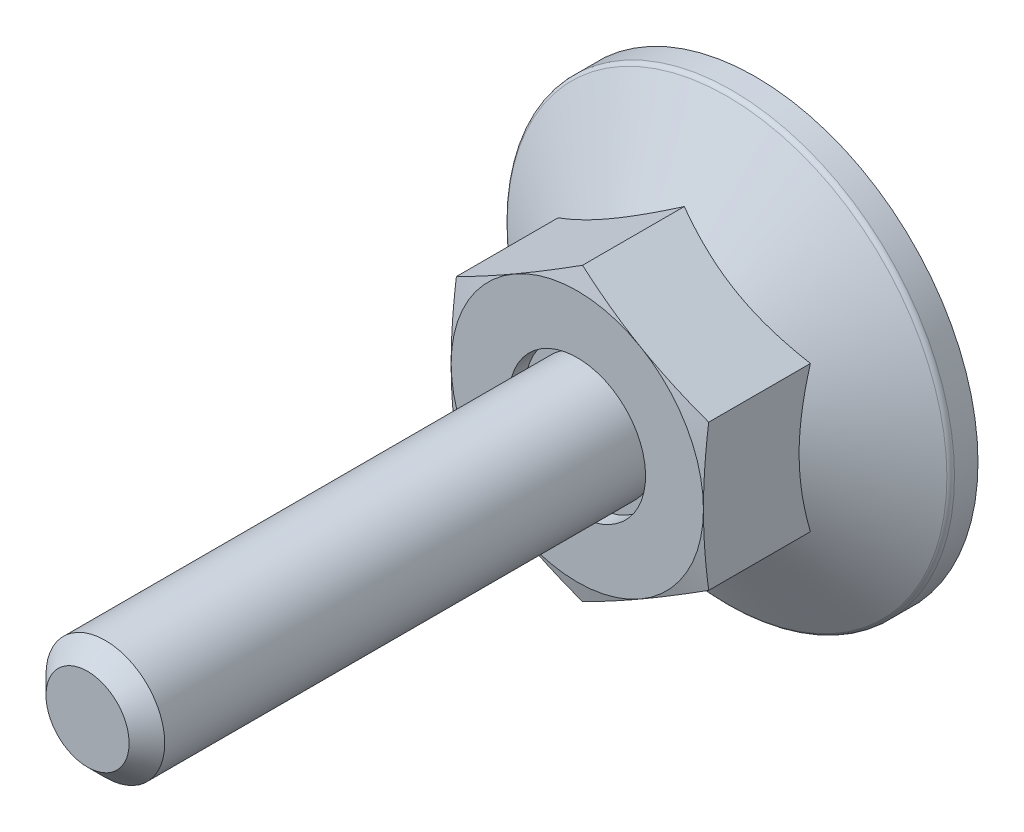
ISO-10303-21;
HEADER;
FILE_DESCRIPTION(('STEP AP214'),'2;1');
FILE_NAME('part.step','',(''),(''),'','','');
FILE_SCHEMA(('AUTOMOTIVE_DESIGN { 1 0 10303 214 1 1 1 1 }'));
ENDSEC;
DATA;
#1=APPLICATION_CONTEXT('core data for automotive mechanical design processes');
#2=APPLICATION_PROTOCOL_DEFINITION('international standard','automotive_design',2000,#1);
#3=PRODUCT_CONTEXT('',#1,'mechanical');
#4=PRODUCT('Part','Part','',(#3));
#5=PRODUCT_RELATED_PRODUCT_CATEGORY('part','',(#4));
#6=PRODUCT_DEFINITION_FORMATION('','',#4);
#7=PRODUCT_DEFINITION_CONTEXT('part definition',#1,'design');
#8=PRODUCT_DEFINITION('design','',#6,#7);
#9=PRODUCT_DEFINITION_SHAPE('','',#8);
#10=(LENGTH_UNIT() NAMED_UNIT(*) SI_UNIT(.MILLI.,.METRE.));
#11=(NAMED_UNIT(*) PLANE_ANGLE_UNIT() SI_UNIT($,.RADIAN.));
#12=(NAMED_UNIT(*) SI_UNIT($,.STERADIAN.) SOLID_ANGLE_UNIT());
#13=UNCERTAINTY_MEASURE_WITH_UNIT(LENGTH_MEASURE(1.E-05),#10,'distance_accuracy_value','');
#14=(GEOMETRIC_REPRESENTATION_CONTEXT(3) GLOBAL_UNCERTAINTY_ASSIGNED_CONTEXT((#13)) GLOBAL_UNIT_ASSIGNED_CONTEXT((#10,
#11,#12)) REPRESENTATION_CONTEXT('',''));
#15=CARTESIAN_POINT('',(0.,0.,0.));
#16=DIRECTION('',(0.,0.,1.));
#17=DIRECTION('',(1.,0.,0.));
#18=AXIS2_PLACEMENT_3D('',#15,#16,#17);
#19=CARTESIAN_POINT('',(0.,0.,10.9));
#20=DIRECTION('',(0.,0.,-1.));
#21=DIRECTION('',(0.,1.,0.));
#22=AXIS2_PLACEMENT_3D('',#19,#20,#21);
#23=PLANE('',#22);
#24=CARTESIAN_POINT('',(0.,0.,10.9));
#25=DIRECTION('',(0.,0.,-1.));
#26=DIRECTION('',(0.,1.,0.));
#27=AXIS2_PLACEMENT_3D('',#24,#25,#26);
#28=CIRCLE('',#27,4.6);
#29=CARTESIAN_POINT('',(0.,4.6,10.9));
#30=VERTEX_POINT('',#29);
#31=EDGE_CURVE('E346',#30,#30,#28,.F.);
#32=ORIENTED_EDGE('',*,*,#31,.T.);
#33=EDGE_LOOP('',(#32));
#34=FACE_BOUND('',#33,.T.);
#35=CARTESIAN_POINT('',(0.,0.,10.9));
#36=DIRECTION('',(0.,0.,-1.));
#37=DIRECTION('',(0.,1.,0.));
#38=AXIS2_PLACEMENT_3D('',#35,#36,#37);
#39=CIRCLE('',#38,4.);
#40=CARTESIAN_POINT('',(0.,4.,10.9));
#41=VERTEX_POINT('',#40);
#42=EDGE_CURVE('E349',#41,#41,#39,.F.);
#43=ORIENTED_EDGE('',*,*,#42,.F.);
#44=EDGE_LOOP('',(#43));
#45=FACE_BOUND('',#44,.T.);
#46=ADVANCED_FACE('F14',(#34,#45),#23,.F.);
#47=CARTESIAN_POINT('',(10.2,0.,0.));
#48=DIRECTION('',(0.,0.,1.));
#49=DIRECTION('',(0.,-1.,0.));
#50=AXIS2_PLACEMENT_3D('',#47,#48,#49);
#51=PLANE('',#50);
#52=DIRECTION('',(1.,0.,0.));
#53=VECTOR('',#52,1.);
#54=CARTESIAN_POINT('',(1.,-1.,0.));
#55=LINE('',#54,#53);
#56=CARTESIAN_POINT('',(1.,-1.,0.));
#57=VERTEX_POINT('',#56);
#58=CARTESIAN_POINT('',(5.,-1.,0.));
#59=VERTEX_POINT('',#58);
#60=EDGE_CURVE('E697',#57,#59,#55,.T.);
#61=ORIENTED_EDGE('',*,*,#60,.T.);
#62=DIRECTION('',(0.,-1.,0.));
#63=VECTOR('',#62,1.);
#64=CARTESIAN_POINT('',(5.,0.,0.));
#65=LINE('',#64,#63);
#66=CARTESIAN_POINT('',(5.,1.,0.));
#67=VERTEX_POINT('',#66);
#68=EDGE_CURVE('E351',#67,#59,#65,.T.);
#69=ORIENTED_EDGE('',*,*,#68,.F.);
#70=DIRECTION('',(-1.,0.,0.));
#71=VECTOR('',#70,1.);
#72=CARTESIAN_POINT('',(5.,1.,0.));
#73=LINE('',#72,#71);
#74=CARTESIAN_POINT('',(1.,1.,0.));
#75=VERTEX_POINT('',#74);
#76=EDGE_CURVE('E700',#67,#75,#73,.T.);
#77=ORIENTED_EDGE('',*,*,#76,.T.);
#78=DIRECTION('',(0.,1.,0.));
#79=VECTOR('',#78,1.);
#80=CARTESIAN_POINT('',(1.,1.,0.));
#81=LINE('',#80,#79);
#82=CARTESIAN_POINT('',(1.,5.,0.));
#83=VERTEX_POINT('',#82);
#84=EDGE_CURVE('E703',#75,#83,#81,.T.);
#85=ORIENTED_EDGE('',*,*,#84,.T.);
#86=DIRECTION('',(-1.,0.,0.));
#87=VECTOR('',#86,1.);
#88=CARTESIAN_POINT('',(1.,5.,0.));
#89=LINE('',#88,#87);
#90=CARTESIAN_POINT('',(-1.,5.,0.));
#91=VERTEX_POINT('',#90);
#92=EDGE_CURVE('E706',#83,#91,#89,.T.);
#93=ORIENTED_EDGE('',*,*,#92,.T.);
#94=DIRECTION('',(0.,-1.,0.));
#95=VECTOR('',#94,1.);
#96=CARTESIAN_POINT('',(-1.,5.,0.));
#97=LINE('',#96,#95);
#98=CARTESIAN_POINT('',(-1.,1.,0.));
#99=VERTEX_POINT('',#98);
#100=EDGE_CURVE('E175',#91,#99,#97,.T.);
#101=ORIENTED_EDGE('',*,*,#100,.T.);
#102=DIRECTION('',(-1.,0.,0.));
#103=VECTOR('',#102,1.);
#104=CARTESIAN_POINT('',(-1.,1.,0.));
#105=LINE('',#104,#103);
#106=CARTESIAN_POINT('',(-5.,1.,0.));
#107=VERTEX_POINT('',#106);
#108=EDGE_CURVE('E29',#99,#107,#105,.T.);
#109=ORIENTED_EDGE('',*,*,#108,.T.);
#110=DIRECTION('',(0.,-1.,0.));
#111=VECTOR('',#110,1.);
#112=CARTESIAN_POINT('',(-5.,1.,0.));
#113=LINE('',#112,#111);
#114=CARTESIAN_POINT('',(-5.,-1.,0.));
#115=VERTEX_POINT('',#114);
#116=EDGE_CURVE('E179',#107,#115,#113,.T.);
#117=ORIENTED_EDGE('',*,*,#116,.T.);
#118=DIRECTION('',(1.,0.,0.));
#119=VECTOR('',#118,1.);
#120=CARTESIAN_POINT('',(-5.,-1.,0.));
#121=LINE('',#120,#119);
#122=CARTESIAN_POINT('',(-1.,-1.,0.));
#123=VERTEX_POINT('',#122);
#124=EDGE_CURVE('E685',#115,#123,#121,.T.);
#125=ORIENTED_EDGE('',*,*,#124,.T.);
#126=DIRECTION('',(0.,-1.,0.));
#127=VECTOR('',#126,1.);
#128=CARTESIAN_POINT('',(-1.,-1.,0.));
#129=LINE('',#128,#127);
#130=CARTESIAN_POINT('',(-1.,-5.,0.));
#131=VERTEX_POINT('',#130);
#132=EDGE_CURVE('E688',#123,#131,#129,.T.);
#133=ORIENTED_EDGE('',*,*,#132,.T.);
#134=DIRECTION('',(1.,0.,0.));
#135=VECTOR('',#134,1.);
#136=CARTESIAN_POINT('',(-1.,-5.,0.));
#137=LINE('',#136,#135);
#138=CARTESIAN_POINT('',(1.,-5.,0.));
#139=VERTEX_POINT('',#138);
#140=EDGE_CURVE('E691',#131,#139,#137,.T.);
#141=ORIENTED_EDGE('',*,*,#140,.T.);
#142=DIRECTION('',(0.,1.,0.));
#143=VECTOR('',#142,1.);
#144=CARTESIAN_POINT('',(1.,-5.,0.));
#145=LINE('',#144,#143);
#146=EDGE_CURVE('E694',#139,#57,#145,.T.);
#147=ORIENTED_EDGE('',*,*,#146,.T.);
#148=EDGE_LOOP('',(#61,#69,#77,#85,#93,#101,#109,#117,#125,#133,#141,#147));
#149=FACE_BOUND('',#148,.T.);
#150=CARTESIAN_POINT('',(0.,0.,0.));
#151=DIRECTION('',(0.,0.,-1.));
#152=DIRECTION('',(0.,1.,0.));
#153=AXIS2_PLACEMENT_3D('',#150,#151,#152);
#154=CIRCLE('',#153,15.);
#155=CARTESIAN_POINT('',(0.,15.,0.));
#156=VERTEX_POINT('',#155);
#157=EDGE_CURVE('E180',#156,#156,#154,.T.);
#158=ORIENTED_EDGE('',*,*,#157,.T.);
#159=EDGE_LOOP('',(#158));
#160=FACE_BOUND('',#159,.T.);
#161=ADVANCED_FACE('F294',(#149,#160),#51,.F.);
#162=CARTESIAN_POINT('',(0.,9.81495457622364,44.));
#163=DIRECTION('',(0.5,-0.866025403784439,0.));
#164=DIRECTION('',(0.866025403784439,0.5,0.));
#165=AXIS2_PLACEMENT_3D('',#162,#163,#164);
#166=PLANE('',#165);
#167=CARTESIAN_POINT('',(-8.5002,4.90736181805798,4.7935207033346));
#168=CARTESIAN_POINT('',(-8.31336077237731,5.01523349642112,4.85579061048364));
#169=CARTESIAN_POINT('',(-8.1258249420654,5.1235073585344,4.91523445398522));
#170=CARTESIAN_POINT('',(-7.74923024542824,5.34093440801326,5.02769163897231));
#171=CARTESIAN_POINT('',(-7.56017075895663,5.45008795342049,5.08070220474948));
#172=CARTESIAN_POINT('',(-6.9899652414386,5.77929626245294,5.22904336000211));
#173=CARTESIAN_POINT('',(-6.60656835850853,6.00065055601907,5.31341782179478));
#174=CARTESIAN_POINT('',(-6.03282233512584,6.33190297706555,5.41235673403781));
#175=CARTESIAN_POINT('',(-5.84418723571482,6.44081150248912,5.44054155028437));
#176=CARTESIAN_POINT('',(-5.46606397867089,6.65912106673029,5.48780266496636));
#177=CARTESIAN_POINT('',(-5.27657589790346,6.76852206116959,5.5068797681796));
#178=CARTESIAN_POINT('',(-4.8972734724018,6.98751241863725,5.53544197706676));
#179=CARTESIAN_POINT('',(-4.70745974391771,7.09710142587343,5.54493796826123));
#180=CARTESIAN_POINT('',(-4.32765694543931,7.3163806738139,5.55413437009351));
#181=CARTESIAN_POINT('',(-4.13766788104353,7.42607091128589,5.5538350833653));
#182=CARTESIAN_POINT('',(-3.78247698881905,7.63114046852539,5.54412227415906));
#183=CARTESIAN_POINT('',(-3.6172500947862,7.72653426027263,5.535893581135));
#184=CARTESIAN_POINT('',(-3.28718328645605,7.9170984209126,5.51218750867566));
#185=CARTESIAN_POINT('',(-3.12234339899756,8.01226877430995,5.49670964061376));
#186=CARTESIAN_POINT('',(-2.62846189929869,8.29741139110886,5.43976812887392));
#187=CARTESIAN_POINT('',(-2.30029449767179,8.48687892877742,5.38780368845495));
#188=CARTESIAN_POINT('',(-1.64047857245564,8.86782383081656,5.25789180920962));
#189=CARTESIAN_POINT('',(-1.30891425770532,9.05925257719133,5.17939367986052));
#190=CARTESIAN_POINT('',(-0.650730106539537,9.43925537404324,5.00123540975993));
#191=CARTESIAN_POINT('',(-0.324101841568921,9.62783429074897,4.90161711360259));
#192=CARTESIAN_POINT('',(0.000199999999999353,9.81507004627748,4.7935207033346));
#193=B_SPLINE_CURVE_WITH_KNOTS('',3,(#167,#168,#169,#170,#171,#172,#173,#174,#175,#176,#177,
#178,#179,#180,#181,#182,#183,#184,#185,#186,#187,#188,#189,#190,#191,#192),.UNSPECIFIED.,.F.,
.F.,(4,2,2,2,2,2,2,2,2,2,2,2,4),(0.,0.673596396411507,1.34748239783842,2.69805431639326,
3.356799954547,4.01548737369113,4.67342558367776,5.33134346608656,5.90409556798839,
6.47688628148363,7.62328361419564,8.79510569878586,9.9646274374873),.UNSPECIFIED.);
#194=CARTESIAN_POINT('',(-8.5,4.90747728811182,4.79358737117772));
#195=VERTEX_POINT('',#194);
#196=CARTESIAN_POINT('',(0.,9.81495457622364,4.79358737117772));
#197=VERTEX_POINT('',#196);
#198=EDGE_CURVE('E251',#195,#197,#193,.T.);
#199=ORIENTED_EDGE('',*,*,#198,.F.);
#200=DIRECTION('',(0.,0.,-1.));
#201=VECTOR('',#200,1.);
#202=CARTESIAN_POINT('',(-8.5,4.90747728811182,44.));
#203=LINE('',#202,#201);
#204=CARTESIAN_POINT('',(-8.5,4.90747728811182,11.6476589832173));
#205=VERTEX_POINT('',#204);
#206=EDGE_CURVE('E408',#205,#195,#203,.T.);
#207=ORIENTED_EDGE('',*,*,#206,.F.);
#208=CARTESIAN_POINT('',(0.000200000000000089,9.81507004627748,11.6476280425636));
#209=CARTESIAN_POINT('',(-0.352800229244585,9.61126526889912,11.7022599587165));
#210=CARTESIAN_POINT('',(-0.706440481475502,9.40709097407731,11.7518566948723));
#211=CARTESIAN_POINT('',(-1.41496987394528,8.99802133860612,11.8389934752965));
#212=CARTESIAN_POINT('',(-1.76985946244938,8.79312573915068,11.8765286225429));
#213=CARTESIAN_POINT('',(-2.47873586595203,8.38385575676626,11.9373509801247));
#214=CARTESIAN_POINT('',(-2.83271788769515,8.17948414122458,11.9607107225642));
#215=CARTESIAN_POINT('',(-3.5411333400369,7.77048028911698,11.9920337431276));
#216=CARTESIAN_POINT('',(-3.89556667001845,7.56584811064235,12.));
#217=CARTESIAN_POINT('',(-4.60443332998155,7.15658375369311,12.));
#218=CARTESIAN_POINT('',(-4.9588666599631,6.95195157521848,11.9920337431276));
#219=CARTESIAN_POINT('',(-5.66728211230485,6.54294772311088,11.9607107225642));
#220=CARTESIAN_POINT('',(-6.02126413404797,6.33857610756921,11.9373509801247));
#221=CARTESIAN_POINT('',(-6.73014053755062,5.92930612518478,11.8765286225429));
#222=CARTESIAN_POINT('',(-7.08503012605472,5.72441052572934,11.8389934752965));
#223=CARTESIAN_POINT('',(-7.7935595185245,5.31534089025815,11.7518566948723));
#224=CARTESIAN_POINT('',(-8.14719977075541,5.11116659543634,11.7022599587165));
#225=CARTESIAN_POINT('',(-8.5002,4.90736181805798,11.6476280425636));
#226=B_SPLINE_CURVE_WITH_KNOTS('',3,(#208,#209,#210,#211,#212,#213,#214,#215,#216,#217,#218,
#219,#220,#221,#222,#223,#224,#225),.UNSPECIFIED.,.F.,.F.,(4,2,2,2,2,2,2,2,4),(0.,
1.23382789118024,2.46815608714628,3.69611406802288,4.92383440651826,6.15155474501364,
7.37951272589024,8.61384092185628,9.84766881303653),.UNSPECIFIED.);
#227=CARTESIAN_POINT('',(-4.25,7.36121593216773,12.));
#228=VERTEX_POINT('',#227);
#229=EDGE_CURVE('E281',#228,#205,#226,.T.);
#230=ORIENTED_EDGE('',*,*,#229,.F.);
#231=CARTESIAN_POINT('',(0.,9.81495457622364,11.6476589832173));
#232=VERTEX_POINT('',#231);
#233=EDGE_CURVE('E372',#232,#228,#226,.T.);
#234=ORIENTED_EDGE('',*,*,#233,.F.);
#235=DIRECTION('',(0.,0.,-1.));
#236=VECTOR('',#235,1.);
#237=CARTESIAN_POINT('',(0.,9.81495457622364,44.));
#238=LINE('',#237,#236);
#239=EDGE_CURVE('E392',#232,#197,#238,.T.);
#240=ORIENTED_EDGE('',*,*,#239,.T.);
#241=EDGE_LOOP('',(#199,#207,#230,#234,#240));
#242=FACE_BOUND('',#241,.T.);
#243=ADVANCED_FACE('F223',(#242),#166,.F.);
#244=CARTESIAN_POINT('',(8.5,4.90747728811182,44.));
#245=DIRECTION('',(-0.5,-0.866025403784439,0.));
#246=DIRECTION('',(0.866025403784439,-0.5,0.));
#247=AXIS2_PLACEMENT_3D('',#244,#245,#246);
#248=PLANE('',#247);
#249=CARTESIAN_POINT('',(-0.0002,9.81507004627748,4.7935207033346));
#250=CARTESIAN_POINT('',(0.186639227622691,9.70719836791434,4.85579061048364));
#251=CARTESIAN_POINT('',(0.374175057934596,9.59892450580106,4.91523445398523));
#252=CARTESIAN_POINT('',(0.750769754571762,9.3814974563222,5.02769163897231));
#253=CARTESIAN_POINT('',(0.939829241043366,9.27234391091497,5.08070220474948));
#254=CARTESIAN_POINT('',(1.5100347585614,8.94313560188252,5.22904336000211));
#255=CARTESIAN_POINT('',(1.89343164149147,8.72178130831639,5.31341782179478));
#256=CARTESIAN_POINT('',(2.46717766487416,8.39052888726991,5.41235673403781));
#257=CARTESIAN_POINT('',(2.65581276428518,8.28162036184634,5.44054155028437));
#258=CARTESIAN_POINT('',(3.03393602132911,8.06331079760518,5.48780266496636));
#259=CARTESIAN_POINT('',(3.22342410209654,7.95390980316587,5.5068797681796));
#260=CARTESIAN_POINT('',(3.6027265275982,7.73491944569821,5.53544197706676));
#261=CARTESIAN_POINT('',(3.79254025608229,7.62533043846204,5.54493796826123));
#262=CARTESIAN_POINT('',(4.17234305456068,7.40605119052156,5.55413437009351));
#263=CARTESIAN_POINT('',(4.36233211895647,7.29636095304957,5.55383508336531));
#264=CARTESIAN_POINT('',(4.71752301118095,7.09129139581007,5.54412227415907));
#265=CARTESIAN_POINT('',(4.8827499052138,6.99589760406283,5.53589358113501));
#266=CARTESIAN_POINT('',(5.21281671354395,6.80533344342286,5.51218750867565));
#267=CARTESIAN_POINT('',(5.37765660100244,6.71016309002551,5.49670964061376));
#268=CARTESIAN_POINT('',(5.87153810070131,6.42502047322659,5.43976812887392));
#269=CARTESIAN_POINT('',(6.19970550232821,6.23555293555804,5.38780368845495));
#270=CARTESIAN_POINT('',(6.85952142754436,5.8546080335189,5.25789180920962));
#271=CARTESIAN_POINT('',(7.19108574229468,5.66317928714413,5.17939367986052));
#272=CARTESIAN_POINT('',(7.84926989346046,5.28317649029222,5.00123540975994));
#273=CARTESIAN_POINT('',(8.17589815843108,5.09459757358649,4.90161711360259));
#274=CARTESIAN_POINT('',(8.5002,4.90736181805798,4.7935207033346));
#275=B_SPLINE_CURVE_WITH_KNOTS('',3,(#249,#250,#251,#252,#253,#254,#255,#256,#257,#258,#259,
#260,#261,#262,#263,#264,#265,#266,#267,#268,#269,#270,#271,#272,#273,#274),.UNSPECIFIED.,.F.,
.F.,(4,2,2,2,2,2,2,2,2,2,2,2,4),(0.,0.673596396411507,1.34748239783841,2.69805431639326,
3.356799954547,4.01548737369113,4.67342558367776,5.33134346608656,5.90409556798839,
6.47688628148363,7.62328361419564,8.79510569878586,9.9646274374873),.UNSPECIFIED.);
#276=CARTESIAN_POINT('',(8.5,4.90747728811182,4.79358737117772));
#277=VERTEX_POINT('',#276);
#278=EDGE_CURVE('E37',#197,#277,#275,.T.);
#279=ORIENTED_EDGE('',*,*,#278,.F.);
#280=ORIENTED_EDGE('',*,*,#239,.F.);
#281=CARTESIAN_POINT('',(8.5002,4.90736181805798,11.6476280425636));
#282=CARTESIAN_POINT('',(8.14719977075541,5.11116659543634,11.7022599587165));
#283=CARTESIAN_POINT('',(7.7935595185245,5.31534089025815,11.7518566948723));
#284=CARTESIAN_POINT('',(7.08503012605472,5.72441052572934,11.8389934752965));
#285=CARTESIAN_POINT('',(6.73014053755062,5.92930612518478,11.8765286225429));
#286=CARTESIAN_POINT('',(6.02126413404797,6.33857610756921,11.9373509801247));
#287=CARTESIAN_POINT('',(5.66728211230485,6.54294772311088,11.9607107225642));
#288=CARTESIAN_POINT('',(4.9588666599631,6.95195157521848,11.9920337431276));
#289=CARTESIAN_POINT('',(4.60443332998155,7.15658375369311,12.));
#290=CARTESIAN_POINT('',(3.89556667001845,7.56584811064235,12.));
#291=CARTESIAN_POINT('',(3.5411333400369,7.77048028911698,11.9920337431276));
#292=CARTESIAN_POINT('',(2.83271788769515,8.17948414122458,11.9607107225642));
#293=CARTESIAN_POINT('',(2.47873586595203,8.38385575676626,11.9373509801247));
#294=CARTESIAN_POINT('',(1.76985946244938,8.79312573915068,11.8765286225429));
#295=CARTESIAN_POINT('',(1.41496987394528,8.99802133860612,11.8389934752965));
#296=CARTESIAN_POINT('',(0.706440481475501,9.40709097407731,11.7518566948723));
#297=CARTESIAN_POINT('',(0.352800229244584,9.61126526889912,11.7022599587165));
#298=CARTESIAN_POINT('',(-0.000200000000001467,9.81507004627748,11.6476280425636));
#299=B_SPLINE_CURVE_WITH_KNOTS('',3,(#281,#282,#283,#284,#285,#286,#287,#288,#289,#290,#291,
#292,#293,#294,#295,#296,#297,#298),.UNSPECIFIED.,.F.,.F.,(4,2,2,2,2,2,2,2,4),(0.,
1.23382789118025,2.46815608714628,3.69611406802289,4.92383440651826,6.15155474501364,
7.37951272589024,8.61384092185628,9.84766881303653),.UNSPECIFIED.);
#300=CARTESIAN_POINT('',(4.25,7.36121593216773,12.));
#301=VERTEX_POINT('',#300);
#302=EDGE_CURVE('E264',#301,#232,#299,.T.);
#303=ORIENTED_EDGE('',*,*,#302,.F.);
#304=CARTESIAN_POINT('',(8.5,4.90747728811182,11.6476589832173));
#305=VERTEX_POINT('',#304);
#306=EDGE_CURVE('E273',#305,#301,#299,.T.);
#307=ORIENTED_EDGE('',*,*,#306,.F.);
#308=DIRECTION('',(0.,0.,-1.));
#309=VECTOR('',#308,1.);
#310=CARTESIAN_POINT('',(8.5,4.90747728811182,44.));
#311=LINE('',#310,#309);
#312=EDGE_CURVE('E395',#305,#277,#311,.T.);
#313=ORIENTED_EDGE('',*,*,#312,.T.);
#314=EDGE_LOOP('',(#279,#280,#303,#307,#313));
#315=FACE_BOUND('',#314,.T.);
#316=ADVANCED_FACE('F257',(#315),#248,.F.);
#317=CARTESIAN_POINT('',(8.5,-4.90747728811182,44.));
#318=DIRECTION('',(-1.,0.,0.));
#319=DIRECTION('',(0.,-1.,0.));
#320=AXIS2_PLACEMENT_3D('',#317,#318,#319);
#321=PLANE('',#320);
#322=CARTESIAN_POINT('',(8.5,13.0314294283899,1.47752704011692));
#323=CARTESIAN_POINT('',(8.5,12.6612665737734,1.65647774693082));
#324=CARTESIAN_POINT('',(8.5,12.290237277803,1.83366776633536));
#325=CARTESIAN_POINT('',(8.5,11.5459841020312,2.1835324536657));
#326=CARTESIAN_POINT('',(8.5,11.1727598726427,2.3562063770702));
#327=CARTESIAN_POINT('',(8.5,10.4216603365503,2.69694543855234));
#328=CARTESIAN_POINT('',(8.5,10.0437706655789,2.86497902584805));
#329=CARTESIAN_POINT('',(8.5,9.2849306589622,3.19396010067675));
#330=CARTESIAN_POINT('',(8.5,8.90398047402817,3.35490793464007));
#331=CARTESIAN_POINT('',(8.5,8.12702308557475,3.67249615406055));
#332=CARTESIAN_POINT('',(8.5,7.73090483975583,3.82886642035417));
#333=CARTESIAN_POINT('',(8.5,6.93398073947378,4.12940330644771));
#334=CARTESIAN_POINT('',(8.5,6.53317435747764,4.27356853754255));
#335=CARTESIAN_POINT('',(8.5,5.72703031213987,4.54580160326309));
#336=CARTESIAN_POINT('',(8.5,5.32170421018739,4.67390329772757));
#337=CARTESIAN_POINT('',(8.5,4.50525785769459,4.90980359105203));
#338=CARTESIAN_POINT('',(8.5,4.09413952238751,5.01760873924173));
#339=CARTESIAN_POINT('',(8.5,3.26789885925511,5.20711197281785));
#340=CARTESIAN_POINT('',(8.5,2.85280627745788,5.28893618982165));
#341=CARTESIAN_POINT('',(8.5,2.22651264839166,5.38853539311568));
#342=CARTESIAN_POINT('',(8.5,2.01712321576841,5.41788026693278));
#343=CARTESIAN_POINT('',(8.5,1.59735566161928,5.46827917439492));
#344=CARTESIAN_POINT('',(8.5,1.38697763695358,5.48933400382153));
#345=CARTESIAN_POINT('',(8.5,0.968196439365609,5.52247691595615));
#346=CARTESIAN_POINT('',(8.5,0.759802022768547,5.53467524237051));
#347=CARTESIAN_POINT('',(8.5,0.342684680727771,5.55026003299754));
#348=CARTESIAN_POINT('',(8.5,0.133961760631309,5.5536466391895));
#349=CARTESIAN_POINT('',(8.5,-0.283445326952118,5.55152742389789));
#350=CARTESIAN_POINT('',(8.5,-0.492129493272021,5.546021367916));
#351=CARTESIAN_POINT('',(8.5,-0.909085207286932,5.52624824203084));
#352=CARTESIAN_POINT('',(8.5,-1.11735673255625,5.51198070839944));
#353=CARTESIAN_POINT('',(8.5,-1.62231800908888,5.46706351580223));
#354=CARTESIAN_POINT('',(8.5,-1.91862399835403,5.43201243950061));
#355=CARTESIAN_POINT('',(8.5,-2.50892471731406,5.34612267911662));
#356=CARTESIAN_POINT('',(8.5,-2.80291910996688,5.29528173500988));
#357=CARTESIAN_POINT('',(8.5,-3.68114216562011,5.12178025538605));
#358=CARTESIAN_POINT('',(8.5,-4.26128126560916,4.97817413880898));
#359=CARTESIAN_POINT('',(8.5,-5.12903133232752,4.73045572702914));
#360=CARTESIAN_POINT('',(8.5,-5.42116721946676,4.64129591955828));
#361=CARTESIAN_POINT('',(8.5,-6.0025970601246,4.45406394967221));
#362=CARTESIAN_POINT('',(8.5,-6.29189099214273,4.35599171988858));
#363=CARTESIAN_POINT('',(8.5,-6.86774141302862,4.15248019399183));
#364=CARTESIAN_POINT('',(8.5,-7.15429879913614,4.0470434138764));
#365=CARTESIAN_POINT('',(8.5,-7.72505625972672,3.83000899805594));
#366=CARTESIAN_POINT('',(8.5,-8.00925638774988,3.71841150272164));
#367=CARTESIAN_POINT('',(8.5,-8.7865968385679,3.40502511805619));
#368=CARTESIAN_POINT('',(8.5,-9.2776226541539,3.197996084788));
#369=CARTESIAN_POINT('',(8.5,-10.2546964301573,2.77246752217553));
#370=CARTESIAN_POINT('',(8.5,-10.7407438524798,2.55396676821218));
#371=CARTESIAN_POINT('',(8.5,-11.7090438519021,2.108282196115));
#372=CARTESIAN_POINT('',(8.5,-12.1912949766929,1.88109523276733));
#373=CARTESIAN_POINT('',(8.5,-13.1526185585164,1.42016244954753));
#374=CARTESIAN_POINT('',(8.5,-13.6316911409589,1.18641689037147));
#375=CARTESIAN_POINT('',(8.5,-14.588034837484,0.713462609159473));
#376=CARTESIAN_POINT('',(8.5,-15.0653020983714,0.47424611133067));
#377=CARTESIAN_POINT('',(8.5,-16.0177905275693,-0.00822936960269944));
#378=CARTESIAN_POINT('',(8.5,-16.4930116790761,-0.251488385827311));
#379=CARTESIAN_POINT('',(8.5,-17.4416812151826,-0.741191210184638));
#380=CARTESIAN_POINT('',(8.5,-17.9151299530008,-0.987634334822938));
#381=CARTESIAN_POINT('',(8.5,-18.8606492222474,-1.48315179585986));
#382=CARTESIAN_POINT('',(8.5,-19.3327197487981,-1.73222614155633));
#383=CARTESIAN_POINT('',(8.5,-20.6461392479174,-2.42904815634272));
#384=CARTESIAN_POINT('',(8.5,-21.4862394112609,-2.87914918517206));
#385=CARTESIAN_POINT('',(8.5,-23.1638169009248,-3.78432075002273));
#386=CARTESIAN_POINT('',(8.5,-24.0012940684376,-4.23939157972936));
#387=CARTESIAN_POINT('',(8.5,-25.671623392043,-5.15180725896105));
#388=CARTESIAN_POINT('',(8.5,-26.5044818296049,-5.60914061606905));
#389=CARTESIAN_POINT('',(8.5,-27.7525740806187,-6.29723391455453));
#390=CARTESIAN_POINT('',(8.5,-28.1683903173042,-6.52693873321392));
#391=CARTESIAN_POINT('',(8.5,-28.9996764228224,-6.98697325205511));
#392=CARTESIAN_POINT('',(8.5,-29.4151462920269,-7.21730295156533));
#393=CARTESIAN_POINT('',(8.5,-29.8304643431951,-7.44790614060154));
#394=B_SPLINE_CURVE_WITH_KNOTS('',3,(#322,#323,#324,#325,#326,#327,#328,#329,#330,#331,#332,
#333,#334,#335,#336,#337,#338,#339,#340,#341,#342,#343,#344,#345,#346,#347,#348,#349,#350,#351,
#352,#353,#354,#355,#356,#357,#358,#359,#360,#361,#362,#363,#364,#365,#366,#367,#368,#369,#370,
#371,#372,#373,#374,#375,#376,#377,#378,#379,#380,#381,#382,#383,#384,#385,#386,#387,#388,#389,
#390,#391,#392,#393),.UNSPECIFIED.,.F.,.F.,(4,2,2,2,2,2,2,2,2,2,2,2,2,2,2,2,2,2,2,2,2,2,2,2,2,2,
2,2,2,2,2,2,2,2,2,4),(0.,1.23346428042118,2.46713064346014,3.70776702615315,4.94834268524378,
6.22578289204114,7.5033682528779,8.77821366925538,10.0526470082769,11.32079515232,
11.9549638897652,12.5890717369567,13.2151443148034,13.8412068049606,14.4672858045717,
15.0933979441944,15.9880059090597,16.8827419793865,18.6732029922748,19.5894472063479,
20.5056983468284,21.4216379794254,22.3375567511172,23.9359919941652,25.5345982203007,
27.1337888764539,28.7329160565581,30.3344778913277,31.9360528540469,33.5372895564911,
35.1385319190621,37.9977422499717,40.8571224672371,43.7075995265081,45.1327331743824,
46.5578652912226),.UNSPECIFIED.);
#395=CARTESIAN_POINT('',(8.5,-4.90747728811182,4.79358737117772));
#396=VERTEX_POINT('',#395);
#397=EDGE_CURVE('E240',#277,#396,#394,.T.);
#398=ORIENTED_EDGE('',*,*,#397,.F.);
#399=ORIENTED_EDGE('',*,*,#312,.F.);
#400=CARTESIAN_POINT('',(8.5,12.9820891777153,10.1197370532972));
#401=CARTESIAN_POINT('',(8.5,12.5964686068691,10.2061594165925));
#402=CARTESIAN_POINT('',(8.5,12.2106068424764,10.2915248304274));
#403=CARTESIAN_POINT('',(8.5,11.4382824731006,10.4595712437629));
#404=CARTESIAN_POINT('',(8.5,11.0518198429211,10.5422521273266));
#405=CARTESIAN_POINT('',(8.5,10.2778290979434,10.7044309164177));
#406=CARTESIAN_POINT('',(8.5,9.89030030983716,10.7839256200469));
#407=CARTESIAN_POINT('',(8.5,9.11443612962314,10.9388739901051));
#408=CARTESIAN_POINT('',(8.5,8.72610074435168,11.0143276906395));
#409=CARTESIAN_POINT('',(8.5,7.95158013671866,11.159650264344));
#410=CARTESIAN_POINT('',(8.5,7.56540239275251,11.2295587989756));
#411=CARTESIAN_POINT('',(8.5,6.79199352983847,11.3632725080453));
#412=CARTESIAN_POINT('',(8.5,6.40476243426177,11.4270778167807));
#413=CARTESIAN_POINT('',(8.5,5.62917169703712,11.54714843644));
#414=CARTESIAN_POINT('',(8.5,5.24081220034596,11.6034146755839));
#415=CARTESIAN_POINT('',(8.5,4.46285737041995,11.70674908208));
#416=CARTESIAN_POINT('',(8.5,4.07326203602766,11.7538172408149));
#417=CARTESIAN_POINT('',(8.5,3.28844017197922,11.8374226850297));
#418=CARTESIAN_POINT('',(8.5,2.89320002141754,11.8738340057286));
#419=CARTESIAN_POINT('',(8.5,2.10172608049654,11.9336139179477));
#420=CARTESIAN_POINT('',(8.5,1.70549231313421,11.9569828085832));
#421=CARTESIAN_POINT('',(8.5,0.91260591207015,11.9893148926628));
#422=CARTESIAN_POINT('',(8.5,0.515953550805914,11.9982846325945));
#423=CARTESIAN_POINT('',(8.5,-0.277408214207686,12.0012669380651));
#424=CARTESIAN_POINT('',(8.5,-0.674117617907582,11.9952795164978));
#425=CARTESIAN_POINT('',(8.5,-1.46847963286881,11.9686842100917));
#426=CARTESIAN_POINT('',(8.5,-1.86613043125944,11.9480232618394));
#427=CARTESIAN_POINT('',(8.5,-2.66049684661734,11.8932602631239));
#428=CARTESIAN_POINT('',(8.5,-3.05721244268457,11.8591579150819));
#429=CARTESIAN_POINT('',(8.5,-3.84970511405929,11.7792347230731));
#430=CARTESIAN_POINT('',(8.5,-4.24548140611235,11.7334062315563));
#431=CARTESIAN_POINT('',(8.5,-5.03576028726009,11.6319377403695));
#432=CARTESIAN_POINT('',(8.5,-5.43026287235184,11.5762977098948));
#433=CARTESIAN_POINT('',(8.5,-6.19195385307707,11.4609360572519));
#434=CARTESIAN_POINT('',(8.5,-6.55922094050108,11.4017287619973));
#435=CARTESIAN_POINT('',(8.5,-7.29278719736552,11.2775674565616));
#436=CARTESIAN_POINT('',(8.5,-7.65908634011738,11.2126132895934));
#437=CARTESIAN_POINT('',(8.5,-8.39085027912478,11.078008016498));
#438=CARTESIAN_POINT('',(8.5,-8.75631499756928,11.0083564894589));
#439=CARTESIAN_POINT('',(8.5,-9.48649515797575,10.8652200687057));
#440=CARTESIAN_POINT('',(8.5,-9.85121059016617,10.7917351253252));
#441=CARTESIAN_POINT('',(8.5,-10.5800753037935,10.6416087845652));
#442=CARTESIAN_POINT('',(8.5,-10.944224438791,10.5649666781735));
#443=CARTESIAN_POINT('',(8.5,-11.6719684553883,10.4090909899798));
#444=CARTESIAN_POINT('',(8.5,-12.0355633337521,10.3298573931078));
#445=CARTESIAN_POINT('',(8.5,-13.1255915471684,10.0889686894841));
#446=CARTESIAN_POINT('',(8.5,-13.8513178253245,9.92411536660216));
#447=CARTESIAN_POINT('',(8.5,-15.2942598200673,9.59010912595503));
#448=CARTESIAN_POINT('',(8.5,-16.0114890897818,9.42101437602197));
#449=CARTESIAN_POINT('',(8.5,-17.4449475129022,9.07858755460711));
#450=CARTESIAN_POINT('',(8.5,-18.1611766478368,8.90525540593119));
#451=CARTESIAN_POINT('',(8.5,-19.5919856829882,8.5556799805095));
#452=CARTESIAN_POINT('',(8.5,-20.306566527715,8.37944056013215));
#453=CARTESIAN_POINT('',(8.5,-21.7351057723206,8.02455520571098));
#454=CARTESIAN_POINT('',(8.5,-22.4490641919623,7.8459093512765));
#455=CARTESIAN_POINT('',(8.5,-23.1628057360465,7.66641079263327));
#456=B_SPLINE_CURVE_WITH_KNOTS('',3,(#400,#401,#402,#403,#404,#405,#406,#407,#408,#409,#410,
#411,#412,#413,#414,#415,#416,#417,#418,#419,#420,#421,#422,#423,#424,#425,#426,#427,#428,#429,
#430,#431,#432,#433,#434,#435,#436,#437,#438,#439,#440,#441,#442,#443,#444,#445,#446,#447,#448,
#449,#450,#451,#452,#453,#454,#455),.UNSPECIFIED.,.F.,.F.,(4,2,2,2,2,2,2,2,2,2,2,2,2,2,2,2,2,2,
2,2,2,2,2,2,2,2,2,4),(0.,1.18556310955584,2.37117735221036,3.55795462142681,4.74472187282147,
5.92204594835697,7.09934411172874,8.27649719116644,9.45365137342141,10.6442044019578,
11.8347301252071,13.0247144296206,14.2146977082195,15.4090063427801,16.6033414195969,
17.7984574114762,18.9935771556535,20.1095500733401,21.2255534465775,22.3416569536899,
23.4577749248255,24.5741449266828,25.6905214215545,27.9231231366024,30.1337863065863,
32.3444897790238,34.5524651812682,36.7603677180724),.UNSPECIFIED.);
#457=CARTESIAN_POINT('',(8.5,0.,12.));
#458=VERTEX_POINT('',#457);
#459=EDGE_CURVE('E275',#458,#305,#456,.F.);
#460=ORIENTED_EDGE('',*,*,#459,.F.);
#461=CARTESIAN_POINT('',(8.5,-4.90747728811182,11.6476589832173));
#462=VERTEX_POINT('',#461);
#463=EDGE_CURVE('E274',#462,#458,#456,.F.);
#464=ORIENTED_EDGE('',*,*,#463,.F.);
#465=DIRECTION('',(0.,0.,-1.));
#466=VECTOR('',#465,1.);
#467=CARTESIAN_POINT('',(8.5,-4.90747728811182,44.));
#468=LINE('',#467,#466);
#469=EDGE_CURVE('E398',#462,#396,#468,.T.);
#470=ORIENTED_EDGE('',*,*,#469,.T.);
#471=EDGE_LOOP('',(#398,#399,#460,#464,#470));
#472=FACE_BOUND('',#471,.T.);
#473=ADVANCED_FACE('F260',(#472),#321,.F.);
#474=CARTESIAN_POINT('',(0.,-9.81495457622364,44.));
#475=DIRECTION('',(-0.5,0.866025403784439,0.));
#476=DIRECTION('',(-0.866025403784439,-0.5,0.));
#477=AXIS2_PLACEMENT_3D('',#474,#475,#476);
#478=PLANE('',#477);
#479=CARTESIAN_POINT('',(8.5002,-4.90736181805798,4.7935207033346));
#480=CARTESIAN_POINT('',(8.31336077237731,-5.01523349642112,4.85579061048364));
#481=CARTESIAN_POINT('',(8.1258249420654,-5.1235073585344,4.91523445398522));
#482=CARTESIAN_POINT('',(7.74923024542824,-5.34093440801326,5.02769163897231));
#483=CARTESIAN_POINT('',(7.56017075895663,-5.45008795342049,5.08070220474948));
#484=CARTESIAN_POINT('',(6.9899652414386,-5.77929626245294,5.22904336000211));
#485=CARTESIAN_POINT('',(6.60656835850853,-6.00065055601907,5.31341782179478));
#486=CARTESIAN_POINT('',(6.03282233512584,-6.33190297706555,5.41235673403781));
#487=CARTESIAN_POINT('',(5.84418723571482,-6.44081150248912,5.44054155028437));
#488=CARTESIAN_POINT('',(5.46606397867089,-6.65912106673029,5.48780266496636));
#489=CARTESIAN_POINT('',(5.27657589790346,-6.76852206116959,5.5068797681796));
#490=CARTESIAN_POINT('',(4.8972734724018,-6.98751241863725,5.53544197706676));
#491=CARTESIAN_POINT('',(4.70745974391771,-7.09710142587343,5.54493796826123));
#492=CARTESIAN_POINT('',(4.32765694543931,-7.3163806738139,5.55413437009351));
#493=CARTESIAN_POINT('',(4.13766788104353,-7.42607091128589,5.5538350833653));
#494=CARTESIAN_POINT('',(3.78247698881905,-7.63114046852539,5.54412227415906));
#495=CARTESIAN_POINT('',(3.6172500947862,-7.72653426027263,5.535893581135));
#496=CARTESIAN_POINT('',(3.28718328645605,-7.9170984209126,5.51218750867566));
#497=CARTESIAN_POINT('',(3.12234339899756,-8.01226877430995,5.49670964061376));
#498=CARTESIAN_POINT('',(2.62846189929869,-8.29741139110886,5.43976812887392));
#499=CARTESIAN_POINT('',(2.30029449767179,-8.48687892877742,5.38780368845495));
#500=CARTESIAN_POINT('',(1.64047857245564,-8.86782383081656,5.25789180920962));
#501=CARTESIAN_POINT('',(1.30891425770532,-9.05925257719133,5.17939367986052));
#502=CARTESIAN_POINT('',(0.650730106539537,-9.43925537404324,5.00123540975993));
#503=CARTESIAN_POINT('',(0.324101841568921,-9.62783429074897,4.90161711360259));
#504=CARTESIAN_POINT('',(-0.000199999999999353,-9.81507004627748,4.7935207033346));
#505=B_SPLINE_CURVE_WITH_KNOTS('',3,(#479,#480,#481,#482,#483,#484,#485,#486,#487,#488,#489,
#490,#491,#492,#493,#494,#495,#496,#497,#498,#499,#500,#501,#502,#503,#504),.UNSPECIFIED.,.F.,
.F.,(4,2,2,2,2,2,2,2,2,2,2,2,4),(0.,0.673596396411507,1.34748239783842,2.69805431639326,
3.356799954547,4.01548737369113,4.67342558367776,5.33134346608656,5.90409556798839,
6.47688628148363,7.62328361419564,8.79510569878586,9.9646274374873),.UNSPECIFIED.);
#506=CARTESIAN_POINT('',(0.,-9.81495457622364,4.79358737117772));
#507=VERTEX_POINT('',#506);
#508=EDGE_CURVE('E204',#396,#507,#505,.T.);
#509=ORIENTED_EDGE('',*,*,#508,.F.);
#510=ORIENTED_EDGE('',*,*,#469,.F.);
#511=CARTESIAN_POINT('',(-0.000200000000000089,-9.81507004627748,11.6476280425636));
#512=CARTESIAN_POINT('',(0.352800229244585,-9.61126526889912,11.7022599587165));
#513=CARTESIAN_POINT('',(0.706440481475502,-9.40709097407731,11.7518566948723));
#514=CARTESIAN_POINT('',(1.41496987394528,-8.99802133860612,11.8389934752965));
#515=CARTESIAN_POINT('',(1.76985946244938,-8.79312573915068,11.8765286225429));
#516=CARTESIAN_POINT('',(2.47873586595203,-8.38385575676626,11.9373509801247));
#517=CARTESIAN_POINT('',(2.83271788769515,-8.17948414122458,11.9607107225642));
#518=CARTESIAN_POINT('',(3.5411333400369,-7.77048028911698,11.9920337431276));
#519=CARTESIAN_POINT('',(3.89556667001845,-7.56584811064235,12.));
#520=CARTESIAN_POINT('',(4.60443332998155,-7.15658375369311,12.));
#521=CARTESIAN_POINT('',(4.9588666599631,-6.95195157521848,11.9920337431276));
#522=CARTESIAN_POINT('',(5.66728211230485,-6.54294772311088,11.9607107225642));
#523=CARTESIAN_POINT('',(6.02126413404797,-6.33857610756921,11.9373509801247));
#524=CARTESIAN_POINT('',(6.73014053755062,-5.92930612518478,11.8765286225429));
#525=CARTESIAN_POINT('',(7.08503012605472,-5.72441052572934,11.8389934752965));
#526=CARTESIAN_POINT('',(7.7935595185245,-5.31534089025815,11.7518566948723));
#527=CARTESIAN_POINT('',(8.14719977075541,-5.11116659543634,11.7022599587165));
#528=CARTESIAN_POINT('',(8.5002,-4.90736181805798,11.6476280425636));
#529=B_SPLINE_CURVE_WITH_KNOTS('',3,(#511,#512,#513,#514,#515,#516,#517,#518,#519,#520,#521,
#522,#523,#524,#525,#526,#527,#528),.UNSPECIFIED.,.F.,.F.,(4,2,2,2,2,2,2,2,4),(0.,
1.23382789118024,2.46815608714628,3.69611406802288,4.92383440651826,6.15155474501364,
7.37951272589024,8.61384092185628,9.84766881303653),.UNSPECIFIED.);
#530=CARTESIAN_POINT('',(4.25,-7.36121593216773,12.));
#531=VERTEX_POINT('',#530);
#532=EDGE_CURVE('E313',#531,#462,#529,.T.);
#533=ORIENTED_EDGE('',*,*,#532,.F.);
#534=CARTESIAN_POINT('',(0.,-9.81495457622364,11.6476589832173));
#535=VERTEX_POINT('',#534);
#536=EDGE_CURVE('E319',#535,#531,#529,.T.);
#537=ORIENTED_EDGE('',*,*,#536,.F.);
#538=DIRECTION('',(0.,0.,-1.));
#539=VECTOR('',#538,1.);
#540=CARTESIAN_POINT('',(0.,-9.81495457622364,44.));
#541=LINE('',#540,#539);
#542=EDGE_CURVE('E403',#535,#507,#541,.T.);
#543=ORIENTED_EDGE('',*,*,#542,.T.);
#544=EDGE_LOOP('',(#509,#510,#533,#537,#543));
#545=FACE_BOUND('',#544,.T.);
#546=ADVANCED_FACE('F321',(#545),#478,.F.);
#547=CARTESIAN_POINT('',(-8.5,-4.90747728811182,44.));
#548=DIRECTION('',(0.5,0.866025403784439,0.));
#549=DIRECTION('',(-0.866025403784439,0.5,0.));
#550=AXIS2_PLACEMENT_3D('',#547,#548,#549);
#551=PLANE('',#550);
#552=CARTESIAN_POINT('',(0.0002,-9.81507004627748,4.7935207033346));
#553=CARTESIAN_POINT('',(-0.186639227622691,-9.70719836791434,4.85579061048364));
#554=CARTESIAN_POINT('',(-0.374175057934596,-9.59892450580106,4.91523445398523));
#555=CARTESIAN_POINT('',(-0.750769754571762,-9.3814974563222,5.02769163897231));
#556=CARTESIAN_POINT('',(-0.939829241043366,-9.27234391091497,5.08070220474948));
#557=CARTESIAN_POINT('',(-1.5100347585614,-8.94313560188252,5.22904336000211));
#558=CARTESIAN_POINT('',(-1.89343164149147,-8.72178130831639,5.31341782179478));
#559=CARTESIAN_POINT('',(-2.46717766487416,-8.39052888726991,5.41235673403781));
#560=CARTESIAN_POINT('',(-2.65581276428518,-8.28162036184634,5.44054155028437));
#561=CARTESIAN_POINT('',(-3.03393602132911,-8.06331079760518,5.48780266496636));
#562=CARTESIAN_POINT('',(-3.22342410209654,-7.95390980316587,5.5068797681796));
#563=CARTESIAN_POINT('',(-3.6027265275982,-7.73491944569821,5.53544197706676));
#564=CARTESIAN_POINT('',(-3.79254025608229,-7.62533043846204,5.54493796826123));
#565=CARTESIAN_POINT('',(-4.17234305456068,-7.40605119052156,5.55413437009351));
#566=CARTESIAN_POINT('',(-4.36233211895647,-7.29636095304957,5.55383508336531));
#567=CARTESIAN_POINT('',(-4.71752301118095,-7.09129139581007,5.54412227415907));
#568=CARTESIAN_POINT('',(-4.8827499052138,-6.99589760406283,5.53589358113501));
#569=CARTESIAN_POINT('',(-5.21281671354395,-6.80533344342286,5.51218750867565));
#570=CARTESIAN_POINT('',(-5.37765660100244,-6.71016309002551,5.49670964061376));
#571=CARTESIAN_POINT('',(-5.87153810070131,-6.42502047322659,5.43976812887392));
#572=CARTESIAN_POINT('',(-6.19970550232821,-6.23555293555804,5.38780368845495));
#573=CARTESIAN_POINT('',(-6.85952142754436,-5.8546080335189,5.25789180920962));
#574=CARTESIAN_POINT('',(-7.19108574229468,-5.66317928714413,5.17939367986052));
#575=CARTESIAN_POINT('',(-7.84926989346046,-5.28317649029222,5.00123540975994));
#576=CARTESIAN_POINT('',(-8.17589815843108,-5.09459757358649,4.90161711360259));
#577=CARTESIAN_POINT('',(-8.5002,-4.90736181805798,4.7935207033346));
#578=B_SPLINE_CURVE_WITH_KNOTS('',3,(#552,#553,#554,#555,#556,#557,#558,#559,#560,#561,#562,
#563,#564,#565,#566,#567,#568,#569,#570,#571,#572,#573,#574,#575,#576,#577),.UNSPECIFIED.,.F.,
.F.,(4,2,2,2,2,2,2,2,2,2,2,2,4),(0.,0.673596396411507,1.34748239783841,2.69805431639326,
3.356799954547,4.01548737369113,4.67342558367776,5.33134346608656,5.90409556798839,
6.47688628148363,7.62328361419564,8.79510569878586,9.9646274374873),.UNSPECIFIED.);
#579=CARTESIAN_POINT('',(-8.5,-4.90747728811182,4.79358737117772));
#580=VERTEX_POINT('',#579);
#581=EDGE_CURVE('E195',#507,#580,#578,.T.);
#582=ORIENTED_EDGE('',*,*,#581,.F.);
#583=ORIENTED_EDGE('',*,*,#542,.F.);
#584=CARTESIAN_POINT('',(-8.5002,-4.90736181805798,11.6476280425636));
#585=CARTESIAN_POINT('',(-8.14719977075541,-5.11116659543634,11.7022599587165));
#586=CARTESIAN_POINT('',(-7.7935595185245,-5.31534089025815,11.7518566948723));
#587=CARTESIAN_POINT('',(-7.08503012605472,-5.72441052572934,11.8389934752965));
#588=CARTESIAN_POINT('',(-6.73014053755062,-5.92930612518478,11.8765286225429));
#589=CARTESIAN_POINT('',(-6.02126413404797,-6.33857610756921,11.9373509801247));
#590=CARTESIAN_POINT('',(-5.66728211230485,-6.54294772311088,11.9607107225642));
#591=CARTESIAN_POINT('',(-4.9588666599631,-6.95195157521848,11.9920337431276));
#592=CARTESIAN_POINT('',(-4.60443332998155,-7.15658375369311,12.));
#593=CARTESIAN_POINT('',(-3.89556667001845,-7.56584811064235,12.));
#594=CARTESIAN_POINT('',(-3.5411333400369,-7.77048028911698,11.9920337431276));
#595=CARTESIAN_POINT('',(-2.83271788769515,-8.17948414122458,11.9607107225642));
#596=CARTESIAN_POINT('',(-2.47873586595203,-8.38385575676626,11.9373509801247));
#597=CARTESIAN_POINT('',(-1.76985946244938,-8.79312573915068,11.8765286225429));
#598=CARTESIAN_POINT('',(-1.41496987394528,-8.99802133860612,11.8389934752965));
#599=CARTESIAN_POINT('',(-0.706440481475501,-9.40709097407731,11.7518566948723));
#600=CARTESIAN_POINT('',(-0.352800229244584,-9.61126526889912,11.7022599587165));
#601=CARTESIAN_POINT('',(0.000200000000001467,-9.81507004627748,11.6476280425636));
#602=B_SPLINE_CURVE_WITH_KNOTS('',3,(#584,#585,#586,#587,#588,#589,#590,#591,#592,#593,#594,
#595,#596,#597,#598,#599,#600,#601),.UNSPECIFIED.,.F.,.F.,(4,2,2,2,2,2,2,2,4),(0.,
1.23382789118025,2.46815608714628,3.69611406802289,4.92383440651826,6.15155474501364,
7.37951272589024,8.61384092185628,9.84766881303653),.UNSPECIFIED.);
#603=CARTESIAN_POINT('',(-4.25,-7.36121593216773,12.));
#604=VERTEX_POINT('',#603);
#605=EDGE_CURVE('E307',#604,#535,#602,.T.);
#606=ORIENTED_EDGE('',*,*,#605,.F.);
#607=CARTESIAN_POINT('',(-8.5,-4.90747728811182,11.6476589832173));
#608=VERTEX_POINT('',#607);
#609=EDGE_CURVE('E320',#608,#604,#602,.T.);
#610=ORIENTED_EDGE('',*,*,#609,.F.);
#611=DIRECTION('',(0.,0.,-1.));
#612=VECTOR('',#611,1.);
#613=CARTESIAN_POINT('',(-8.5,-4.90747728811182,44.));
#614=LINE('',#613,#612);
#615=EDGE_CURVE('E406',#608,#580,#614,.T.);
#616=ORIENTED_EDGE('',*,*,#615,.T.);
#617=EDGE_LOOP('',(#582,#583,#606,#610,#616));
#618=FACE_BOUND('',#617,.T.);
#619=ADVANCED_FACE('F211',(#618),#551,.F.);
#620=CARTESIAN_POINT('',(-8.5,4.90747728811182,44.));
#621=DIRECTION('',(1.,0.,0.));
#622=DIRECTION('',(0.,1.,0.));
#623=AXIS2_PLACEMENT_3D('',#620,#621,#622);
#624=PLANE('',#623);
#625=CARTESIAN_POINT('',(-8.5,13.0314294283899,1.47752704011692));
#626=CARTESIAN_POINT('',(-8.5,12.6612665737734,1.65647774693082));
#627=CARTESIAN_POINT('',(-8.5,12.290237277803,1.83366776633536));
#628=CARTESIAN_POINT('',(-8.5,11.5459841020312,2.1835324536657));
#629=CARTESIAN_POINT('',(-8.5,11.1727598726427,2.3562063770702));
#630=CARTESIAN_POINT('',(-8.5,10.4216603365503,2.69694543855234));
#631=CARTESIAN_POINT('',(-8.5,10.0437706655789,2.86497902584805));
#632=CARTESIAN_POINT('',(-8.5,9.2849306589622,3.19396010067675));
#633=CARTESIAN_POINT('',(-8.5,8.90398047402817,3.35490793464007));
#634=CARTESIAN_POINT('',(-8.5,8.12702308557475,3.67249615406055));
#635=CARTESIAN_POINT('',(-8.5,7.73090483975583,3.82886642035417));
#636=CARTESIAN_POINT('',(-8.5,6.93398073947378,4.12940330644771));
#637=CARTESIAN_POINT('',(-8.5,6.53317435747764,4.27356853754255));
#638=CARTESIAN_POINT('',(-8.5,5.72703031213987,4.54580160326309));
#639=CARTESIAN_POINT('',(-8.5,5.32170421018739,4.67390329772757));
#640=CARTESIAN_POINT('',(-8.5,4.50525785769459,4.90980359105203));
#641=CARTESIAN_POINT('',(-8.5,4.09413952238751,5.01760873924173));
#642=CARTESIAN_POINT('',(-8.5,3.26789885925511,5.20711197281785));
#643=CARTESIAN_POINT('',(-8.5,2.85280627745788,5.28893618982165));
#644=CARTESIAN_POINT('',(-8.5,2.22651264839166,5.38853539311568));
#645=CARTESIAN_POINT('',(-8.5,2.01712321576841,5.41788026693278));
#646=CARTESIAN_POINT('',(-8.5,1.59735566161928,5.46827917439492));
#647=CARTESIAN_POINT('',(-8.5,1.38697763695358,5.48933400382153));
#648=CARTESIAN_POINT('',(-8.5,0.968196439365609,5.52247691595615));
#649=CARTESIAN_POINT('',(-8.5,0.759802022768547,5.53467524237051));
#650=CARTESIAN_POINT('',(-8.5,0.342684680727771,5.55026003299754));
#651=CARTESIAN_POINT('',(-8.5,0.133961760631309,5.5536466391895));
#652=CARTESIAN_POINT('',(-8.5,-0.283445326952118,5.55152742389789));
#653=CARTESIAN_POINT('',(-8.5,-0.492129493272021,5.546021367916));
#654=CARTESIAN_POINT('',(-8.5,-0.909085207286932,5.52624824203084));
#655=CARTESIAN_POINT('',(-8.5,-1.11735673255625,5.51198070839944));
#656=CARTESIAN_POINT('',(-8.5,-1.62231800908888,5.46706351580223));
#657=CARTESIAN_POINT('',(-8.5,-1.91862399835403,5.43201243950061));
#658=CARTESIAN_POINT('',(-8.5,-2.50892471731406,5.34612267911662));
#659=CARTESIAN_POINT('',(-8.5,-2.80291910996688,5.29528173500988));
#660=CARTESIAN_POINT('',(-8.5,-3.68114216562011,5.12178025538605));
#661=CARTESIAN_POINT('',(-8.5,-4.26128126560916,4.97817413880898));
#662=CARTESIAN_POINT('',(-8.5,-5.12903133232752,4.73045572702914));
#663=CARTESIAN_POINT('',(-8.5,-5.42116721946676,4.64129591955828));
#664=CARTESIAN_POINT('',(-8.5,-6.0025970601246,4.45406394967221));
#665=CARTESIAN_POINT('',(-8.5,-6.29189099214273,4.35599171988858));
#666=CARTESIAN_POINT('',(-8.5,-6.86774141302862,4.15248019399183));
#667=CARTESIAN_POINT('',(-8.5,-7.15429879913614,4.0470434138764));
#668=CARTESIAN_POINT('',(-8.5,-7.72505625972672,3.83000899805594));
#669=CARTESIAN_POINT('',(-8.5,-8.00925638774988,3.71841150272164));
#670=CARTESIAN_POINT('',(-8.5,-8.7865968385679,3.40502511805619));
#671=CARTESIAN_POINT('',(-8.5,-9.2776226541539,3.197996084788));
#672=CARTESIAN_POINT('',(-8.5,-10.2546964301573,2.77246752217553));
#673=CARTESIAN_POINT('',(-8.5,-10.7407438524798,2.55396676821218));
#674=CARTESIAN_POINT('',(-8.5,-11.7090438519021,2.108282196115));
#675=CARTESIAN_POINT('',(-8.5,-12.1912949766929,1.88109523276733));
#676=CARTESIAN_POINT('',(-8.5,-13.1526185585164,1.42016244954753));
#677=CARTESIAN_POINT('',(-8.5,-13.6316911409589,1.18641689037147));
#678=CARTESIAN_POINT('',(-8.5,-14.588034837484,0.713462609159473));
#679=CARTESIAN_POINT('',(-8.5,-15.0653020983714,0.47424611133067));
#680=CARTESIAN_POINT('',(-8.5,-16.0177905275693,-0.00822936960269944));
#681=CARTESIAN_POINT('',(-8.5,-16.4930116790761,-0.251488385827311));
#682=CARTESIAN_POINT('',(-8.5,-17.4416812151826,-0.741191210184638));
#683=CARTESIAN_POINT('',(-8.5,-17.9151299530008,-0.987634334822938));
#684=CARTESIAN_POINT('',(-8.5,-18.8606492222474,-1.48315179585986));
#685=CARTESIAN_POINT('',(-8.5,-19.3327197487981,-1.73222614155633));
#686=CARTESIAN_POINT('',(-8.5,-20.6461392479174,-2.42904815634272));
#687=CARTESIAN_POINT('',(-8.5,-21.4862394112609,-2.87914918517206));
#688=CARTESIAN_POINT('',(-8.5,-23.1638169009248,-3.78432075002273));
#689=CARTESIAN_POINT('',(-8.5,-24.0012940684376,-4.23939157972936));
#690=CARTESIAN_POINT('',(-8.5,-25.671623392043,-5.15180725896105));
#691=CARTESIAN_POINT('',(-8.5,-26.5044818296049,-5.60914061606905));
#692=CARTESIAN_POINT('',(-8.5,-27.7525740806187,-6.29723391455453));
#693=CARTESIAN_POINT('',(-8.5,-28.1683903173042,-6.52693873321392));
#694=CARTESIAN_POINT('',(-8.5,-28.9996764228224,-6.98697325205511));
#695=CARTESIAN_POINT('',(-8.5,-29.4151462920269,-7.21730295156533));
#696=CARTESIAN_POINT('',(-8.5,-29.8304643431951,-7.44790614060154));
#697=B_SPLINE_CURVE_WITH_KNOTS('',3,(#625,#626,#627,#628,#629,#630,#631,#632,#633,#634,#635,
#636,#637,#638,#639,#640,#641,#642,#643,#644,#645,#646,#647,#648,#649,#650,#651,#652,#653,#654,
#655,#656,#657,#658,#659,#660,#661,#662,#663,#664,#665,#666,#667,#668,#669,#670,#671,#672,#673,
#674,#675,#676,#677,#678,#679,#680,#681,#682,#683,#684,#685,#686,#687,#688,#689,#690,#691,#692,
#693,#694,#695,#696),.UNSPECIFIED.,.F.,.F.,(4,2,2,2,2,2,2,2,2,2,2,2,2,2,2,2,2,2,2,2,2,2,2,2,2,2,
2,2,2,2,2,2,2,2,2,4),(0.,1.23346428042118,2.46713064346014,3.70776702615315,4.94834268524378,
6.22578289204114,7.5033682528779,8.77821366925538,10.0526470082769,11.32079515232,
11.9549638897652,12.5890717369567,13.2151443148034,13.8412068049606,14.4672858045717,
15.0933979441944,15.9880059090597,16.8827419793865,18.6732029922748,19.5894472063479,
20.5056983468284,21.4216379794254,22.3375567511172,23.9359919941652,25.5345982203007,
27.1337888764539,28.7329160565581,30.3344778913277,31.9360528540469,33.5372895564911,
35.1385319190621,37.9977422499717,40.8571224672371,43.7075995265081,45.1327331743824,
46.5578652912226),.UNSPECIFIED.);
#698=EDGE_CURVE('E229',#580,#195,#697,.F.);
#699=ORIENTED_EDGE('',*,*,#698,.F.);
#700=ORIENTED_EDGE('',*,*,#615,.F.);
#701=CARTESIAN_POINT('',(-8.5,12.9820891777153,10.1197370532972));
#702=CARTESIAN_POINT('',(-8.5,12.5964686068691,10.2061594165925));
#703=CARTESIAN_POINT('',(-8.5,12.2106068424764,10.2915248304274));
#704=CARTESIAN_POINT('',(-8.5,11.4382824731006,10.4595712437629));
#705=CARTESIAN_POINT('',(-8.5,11.0518198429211,10.5422521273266));
#706=CARTESIAN_POINT('',(-8.5,10.2778290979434,10.7044309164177));
#707=CARTESIAN_POINT('',(-8.5,9.89030030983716,10.7839256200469));
#708=CARTESIAN_POINT('',(-8.5,9.11443612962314,10.9388739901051));
#709=CARTESIAN_POINT('',(-8.5,8.72610074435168,11.0143276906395));
#710=CARTESIAN_POINT('',(-8.5,7.95158013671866,11.159650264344));
#711=CARTESIAN_POINT('',(-8.5,7.56540239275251,11.2295587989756));
#712=CARTESIAN_POINT('',(-8.5,6.79199352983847,11.3632725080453));
#713=CARTESIAN_POINT('',(-8.5,6.40476243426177,11.4270778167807));
#714=CARTESIAN_POINT('',(-8.5,5.62917169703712,11.54714843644));
#715=CARTESIAN_POINT('',(-8.5,5.24081220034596,11.6034146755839));
#716=CARTESIAN_POINT('',(-8.5,4.46285737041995,11.70674908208));
#717=CARTESIAN_POINT('',(-8.5,4.07326203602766,11.7538172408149));
#718=CARTESIAN_POINT('',(-8.5,3.28844017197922,11.8374226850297));
#719=CARTESIAN_POINT('',(-8.5,2.89320002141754,11.8738340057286));
#720=CARTESIAN_POINT('',(-8.5,2.10172608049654,11.9336139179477));
#721=CARTESIAN_POINT('',(-8.5,1.70549231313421,11.9569828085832));
#722=CARTESIAN_POINT('',(-8.5,0.91260591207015,11.9893148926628));
#723=CARTESIAN_POINT('',(-8.5,0.515953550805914,11.9982846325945));
#724=CARTESIAN_POINT('',(-8.5,-0.277408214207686,12.0012669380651));
#725=CARTESIAN_POINT('',(-8.5,-0.674117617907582,11.9952795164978));
#726=CARTESIAN_POINT('',(-8.5,-1.46847963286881,11.9686842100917));
#727=CARTESIAN_POINT('',(-8.5,-1.86613043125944,11.9480232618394));
#728=CARTESIAN_POINT('',(-8.5,-2.66049684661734,11.8932602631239));
#729=CARTESIAN_POINT('',(-8.5,-3.05721244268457,11.8591579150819));
#730=CARTESIAN_POINT('',(-8.5,-3.84970511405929,11.7792347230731));
#731=CARTESIAN_POINT('',(-8.5,-4.24548140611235,11.7334062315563));
#732=CARTESIAN_POINT('',(-8.5,-5.03576028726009,11.6319377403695));
#733=CARTESIAN_POINT('',(-8.5,-5.43026287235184,11.5762977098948));
#734=CARTESIAN_POINT('',(-8.5,-6.19195385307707,11.4609360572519));
#735=CARTESIAN_POINT('',(-8.5,-6.55922094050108,11.4017287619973));
#736=CARTESIAN_POINT('',(-8.5,-7.29278719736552,11.2775674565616));
#737=CARTESIAN_POINT('',(-8.5,-7.65908634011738,11.2126132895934));
#738=CARTESIAN_POINT('',(-8.5,-8.39085027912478,11.078008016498));
#739=CARTESIAN_POINT('',(-8.5,-8.75631499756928,11.0083564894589));
#740=CARTESIAN_POINT('',(-8.5,-9.48649515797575,10.8652200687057));
#741=CARTESIAN_POINT('',(-8.5,-9.85121059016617,10.7917351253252));
#742=CARTESIAN_POINT('',(-8.5,-10.5800753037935,10.6416087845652));
#743=CARTESIAN_POINT('',(-8.5,-10.944224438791,10.5649666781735));
#744=CARTESIAN_POINT('',(-8.5,-11.6719684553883,10.4090909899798));
#745=CARTESIAN_POINT('',(-8.5,-12.0355633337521,10.3298573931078));
#746=CARTESIAN_POINT('',(-8.5,-13.1255915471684,10.0889686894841));
#747=CARTESIAN_POINT('',(-8.5,-13.8513178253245,9.92411536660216));
#748=CARTESIAN_POINT('',(-8.5,-15.2942598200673,9.59010912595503));
#749=CARTESIAN_POINT('',(-8.5,-16.0114890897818,9.42101437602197));
#750=CARTESIAN_POINT('',(-8.5,-17.4449475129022,9.07858755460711));
#751=CARTESIAN_POINT('',(-8.5,-18.1611766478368,8.90525540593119));
#752=CARTESIAN_POINT('',(-8.5,-19.5919856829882,8.5556799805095));
#753=CARTESIAN_POINT('',(-8.5,-20.306566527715,8.37944056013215));
#754=CARTESIAN_POINT('',(-8.5,-21.7351057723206,8.02455520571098));
#755=CARTESIAN_POINT('',(-8.5,-22.4490641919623,7.8459093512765));
#756=CARTESIAN_POINT('',(-8.5,-23.1628057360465,7.66641079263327));
#757=B_SPLINE_CURVE_WITH_KNOTS('',3,(#701,#702,#703,#704,#705,#706,#707,#708,#709,#710,#711,
#712,#713,#714,#715,#716,#717,#718,#719,#720,#721,#722,#723,#724,#725,#726,#727,#728,#729,#730,
#731,#732,#733,#734,#735,#736,#737,#738,#739,#740,#741,#742,#743,#744,#745,#746,#747,#748,#749,
#750,#751,#752,#753,#754,#755,#756),.UNSPECIFIED.,.F.,.F.,(4,2,2,2,2,2,2,2,2,2,2,2,2,2,2,2,2,2,
2,2,2,2,2,2,2,2,2,4),(0.,1.18556310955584,2.37117735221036,3.55795462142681,4.74472187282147,
5.92204594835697,7.09934411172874,8.27649719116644,9.45365137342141,10.6442044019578,
11.8347301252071,13.0247144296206,14.2146977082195,15.4090063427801,16.6033414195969,
17.7984574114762,18.9935771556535,20.1095500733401,21.2255534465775,22.3416569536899,
23.4577749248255,24.5741449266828,25.6905214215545,27.9231231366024,30.1337863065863,
32.3444897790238,34.5524651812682,36.7603677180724),.UNSPECIFIED.);
#758=CARTESIAN_POINT('',(-8.5,0.,12.));
#759=VERTEX_POINT('',#758);
#760=EDGE_CURVE('E298',#759,#608,#757,.T.);
#761=ORIENTED_EDGE('',*,*,#760,.F.);
#762=EDGE_CURVE('E397',#205,#759,#757,.T.);
#763=ORIENTED_EDGE('',*,*,#762,.F.);
#764=ORIENTED_EDGE('',*,*,#206,.T.);
#765=EDGE_LOOP('',(#699,#700,#761,#763,#764));
#766=FACE_BOUND('',#765,.T.);
#767=ADVANCED_FACE('F332',(#766),#624,.F.);
#768=CARTESIAN_POINT('',(0.,0.,12.));
#769=DIRECTION('',(0.,0.,-1.));
#770=DIRECTION('',(0.,1.,0.));
#771=AXIS2_PLACEMENT_3D('',#768,#769,#770);
#772=CONICAL_SURFACE('',#771,8.5,1.30899693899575);
#773=ORIENTED_EDGE('',*,*,#532,.T.);
#774=ORIENTED_EDGE('',*,*,#463,.T.);
#775=CARTESIAN_POINT('',(0.,0.,12.));
#776=DIRECTION('',(0.,0.,-1.));
#777=DIRECTION('',(0.,1.,0.));
#778=AXIS2_PLACEMENT_3D('',#775,#776,#777);
#779=CIRCLE('',#778,8.5);
#780=EDGE_CURVE('E359',#458,#531,#779,.T.);
#781=ORIENTED_EDGE('',*,*,#780,.T.);
#782=EDGE_LOOP('',(#773,#774,#781));
#783=FACE_BOUND('',#782,.T.);
#784=ADVANCED_FACE('F292',(#783),#772,.T.);
#785=EDGE_CURVE('E364',#301,#458,#779,.T.);
#786=ORIENTED_EDGE('',*,*,#785,.T.);
#787=ORIENTED_EDGE('',*,*,#459,.T.);
#788=ORIENTED_EDGE('',*,*,#306,.T.);
#789=EDGE_LOOP('',(#786,#787,#788));
#790=FACE_BOUND('',#789,.T.);
#791=ADVANCED_FACE('F386',(#790),#772,.T.);
#792=EDGE_CURVE('E371',#228,#301,#779,.T.);
#793=ORIENTED_EDGE('',*,*,#792,.T.);
#794=ORIENTED_EDGE('',*,*,#302,.T.);
#795=ORIENTED_EDGE('',*,*,#233,.T.);
#796=EDGE_LOOP('',(#793,#794,#795));
#797=FACE_BOUND('',#796,.T.);
#798=ADVANCED_FACE('F391',(#797),#772,.T.);
#799=ORIENTED_EDGE('',*,*,#605,.T.);
#800=ORIENTED_EDGE('',*,*,#536,.T.);
#801=EDGE_CURVE('E363',#531,#604,#779,.T.);
#802=ORIENTED_EDGE('',*,*,#801,.T.);
#803=EDGE_LOOP('',(#799,#800,#802));
#804=FACE_BOUND('',#803,.T.);
#805=ADVANCED_FACE('F757',(#804),#772,.T.);
#806=EDGE_CURVE('E378',#759,#228,#779,.T.);
#807=ORIENTED_EDGE('',*,*,#806,.T.);
#808=ORIENTED_EDGE('',*,*,#229,.T.);
#809=ORIENTED_EDGE('',*,*,#762,.T.);
#810=EDGE_LOOP('',(#807,#808,#809));
#811=FACE_BOUND('',#810,.T.);
#812=ADVANCED_FACE('F293',(#811),#772,.T.);
#813=CARTESIAN_POINT('',(3.6,0.,12.));
#814=DIRECTION('',(0.,0.,-1.));
#815=DIRECTION('',(0.,1.,0.));
#816=AXIS2_PLACEMENT_3D('',#813,#814,#815);
#817=PLANE('',#816);
#818=CARTESIAN_POINT('',(0.,0.,12.));
#819=DIRECTION('',(0.,0.,1.));
#820=DIRECTION('',(0.,-1.,0.));
#821=AXIS2_PLACEMENT_3D('',#818,#819,#820);
#822=CIRCLE('',#821,4.6);
#823=CARTESIAN_POINT('',(0.,-4.6,12.));
#824=VERTEX_POINT('',#823);
#825=EDGE_CURVE('E660',#824,#824,#822,.T.);
#826=ORIENTED_EDGE('',*,*,#825,.F.);
#827=EDGE_LOOP('',(#826));
#828=FACE_BOUND('',#827,.T.);
#829=ORIENTED_EDGE('',*,*,#780,.F.);
#830=ORIENTED_EDGE('',*,*,#785,.F.);
#831=ORIENTED_EDGE('',*,*,#792,.F.);
#832=ORIENTED_EDGE('',*,*,#806,.F.);
#833=EDGE_CURVE('E369',#604,#759,#779,.T.);
#834=ORIENTED_EDGE('',*,*,#833,.F.);
#835=ORIENTED_EDGE('',*,*,#801,.F.);
#836=EDGE_LOOP('',(#829,#830,#831,#832,#834,#835));
#837=FACE_BOUND('',#836,.T.);
#838=ADVANCED_FACE('F290',(#828,#837),#817,.F.);
#839=ORIENTED_EDGE('',*,*,#760,.T.);
#840=ORIENTED_EDGE('',*,*,#609,.T.);
#841=ORIENTED_EDGE('',*,*,#833,.T.);
#842=EDGE_LOOP('',(#839,#840,#841));
#843=FACE_BOUND('',#842,.T.);
#844=ADVANCED_FACE('F220',(#843),#772,.T.);
#845=CARTESIAN_POINT('',(0.,0.,10.4602540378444));
#846=DIRECTION('',(0.,0.,-1.));
#847=DIRECTION('',(0.,1.,0.));
#848=AXIS2_PLACEMENT_3D('',#845,#846,#847);
#849=CONICAL_SURFACE('',#848,0.,1.0471975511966);
#850=CARTESIAN_POINT('',(0.,0.,1.90825317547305));
#851=DIRECTION('',(0.,0.,-1.));
#852=DIRECTION('',(0.,1.,0.));
#853=AXIS2_PLACEMENT_3D('',#850,#851,#852);
#854=CIRCLE('',#853,14.8125);
#855=CARTESIAN_POINT('',(0.,14.8125,1.90825317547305));
#856=VERTEX_POINT('',#855);
#857=EDGE_CURVE('E192',#856,#856,#854,.T.);
#858=ORIENTED_EDGE('',*,*,#857,.F.);
#859=EDGE_LOOP('',(#858));
#860=FACE_BOUND('',#859,.T.);
#861=ORIENTED_EDGE('',*,*,#698,.T.);
#862=ORIENTED_EDGE('',*,*,#198,.T.);
#863=ORIENTED_EDGE('',*,*,#278,.T.);
#864=ORIENTED_EDGE('',*,*,#397,.T.);
#865=ORIENTED_EDGE('',*,*,#508,.T.);
#866=ORIENTED_EDGE('',*,*,#581,.T.);
#867=EDGE_LOOP('',(#861,#862,#863,#864,#865,#866));
#868=FACE_BOUND('',#867,.T.);
#869=ADVANCED_FACE('F214',(#860,#868),#849,.T.);
#870=CARTESIAN_POINT('',(0.,0.,1.58349364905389));
#871=DIRECTION('',(0.,0.,-1.));
#872=DIRECTION('',(0.,1.,0.));
#873=AXIS2_PLACEMENT_3D('',#870,#871,#872);
#874=TOROIDAL_SURFACE('',#873,14.625,0.375);
#875=ORIENTED_EDGE('',*,*,#857,.T.);
#876=EDGE_LOOP('',(#875));
#877=FACE_BOUND('',#876,.T.);
#878=CARTESIAN_POINT('',(0.,0.,1.58349365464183));
#879=DIRECTION('',(0.,0.,-1.));
#880=DIRECTION('',(0.,1.,0.));
#881=AXIS2_PLACEMENT_3D('',#878,#879,#880);
#882=CIRCLE('',#881,15.);
#883=CARTESIAN_POINT('',(0.,15.,1.58349365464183));
#884=VERTEX_POINT('',#883);
#885=EDGE_CURVE('E184',#884,#884,#882,.T.);
#886=ORIENTED_EDGE('',*,*,#885,.F.);
#887=EDGE_LOOP('',(#886));
#888=FACE_BOUND('',#887,.T.);
#889=ADVANCED_FACE('F219',(#877,#888),#874,.T.);
#890=CARTESIAN_POINT('',(0.,0.,0.));
#891=DIRECTION('',(0.,0.,-1.));
#892=DIRECTION('',(0.,1.,0.));
#893=AXIS2_PLACEMENT_3D('',#890,#891,#892);
#894=CYLINDRICAL_SURFACE('',#893,15.);
#895=ORIENTED_EDGE('',*,*,#157,.F.);
#896=EDGE_LOOP('',(#895));
#897=FACE_BOUND('',#896,.T.);
#898=ORIENTED_EDGE('',*,*,#885,.T.);
#899=EDGE_LOOP('',(#898));
#900=FACE_BOUND('',#899,.T.);
#901=ADVANCED_FACE('F480',(#897,#900),#894,.T.);
#902=CARTESIAN_POINT('',(-1.,1.,1.));
#903=DIRECTION('',(0.,-1.,0.));
#904=DIRECTION('',(1.,0.,0.));
#905=AXIS2_PLACEMENT_3D('',#902,#903,#904);
#906=PLANE('',#905);
#907=ORIENTED_EDGE('',*,*,#108,.F.);
#908=DIRECTION('',(0.,0.,-1.));
#909=VECTOR('',#908,1.);
#910=CARTESIAN_POINT('',(-1.,1.,1.));
#911=LINE('',#910,#909);
#912=CARTESIAN_POINT('',(-1.,1.,1.));
#913=VERTEX_POINT('',#912);
#914=EDGE_CURVE('E174',#913,#99,#911,.T.);
#915=ORIENTED_EDGE('',*,*,#914,.F.);
#916=DIRECTION('',(-1.,0.,0.));
#917=VECTOR('',#916,1.);
#918=CARTESIAN_POINT('',(-1.,1.,1.));
#919=LINE('',#918,#917);
#920=CARTESIAN_POINT('',(-5.,1.,1.));
#921=VERTEX_POINT('',#920);
#922=EDGE_CURVE('E165',#913,#921,#919,.T.);
#923=ORIENTED_EDGE('',*,*,#922,.T.);
#924=DIRECTION('',(0.,0.,-1.));
#925=VECTOR('',#924,1.);
#926=CARTESIAN_POINT('',(-5.,1.,1.));
#927=LINE('',#926,#925);
#928=EDGE_CURVE('E173',#921,#107,#927,.T.);
#929=ORIENTED_EDGE('',*,*,#928,.T.);
#930=EDGE_LOOP('',(#907,#915,#923,#929));
#931=FACE_BOUND('',#930,.T.);
#932=ADVANCED_FACE('F172',(#931),#906,.T.);
#933=CARTESIAN_POINT('',(-5.,1.,1.));
#934=DIRECTION('',(1.,0.,0.));
#935=DIRECTION('',(0.,1.,0.));
#936=AXIS2_PLACEMENT_3D('',#933,#934,#935);
#937=PLANE('',#936);
#938=ORIENTED_EDGE('',*,*,#116,.F.);
#939=ORIENTED_EDGE('',*,*,#928,.F.);
#940=DIRECTION('',(0.,-1.,0.));
#941=VECTOR('',#940,1.);
#942=CARTESIAN_POINT('',(-5.,1.,1.));
#943=LINE('',#942,#941);
#944=CARTESIAN_POINT('',(-5.,-1.,1.));
#945=VERTEX_POINT('',#944);
#946=EDGE_CURVE('E161',#921,#945,#943,.T.);
#947=ORIENTED_EDGE('',*,*,#946,.T.);
#948=DIRECTION('',(0.,0.,-1.));
#949=VECTOR('',#948,1.);
#950=CARTESIAN_POINT('',(-5.,-1.,1.));
#951=LINE('',#950,#949);
#952=EDGE_CURVE('E181',#945,#115,#951,.T.);
#953=ORIENTED_EDGE('',*,*,#952,.T.);
#954=EDGE_LOOP('',(#938,#939,#947,#953));
#955=FACE_BOUND('',#954,.T.);
#956=ADVANCED_FACE('F177',(#955),#937,.T.);
#957=CARTESIAN_POINT('',(-5.,-1.,1.));
#958=DIRECTION('',(0.,1.,0.));
#959=DIRECTION('',(-1.,0.,0.));
#960=AXIS2_PLACEMENT_3D('',#957,#958,#959);
#961=PLANE('',#960);
#962=ORIENTED_EDGE('',*,*,#124,.F.);
#963=ORIENTED_EDGE('',*,*,#952,.F.);
#964=DIRECTION('',(1.,0.,0.));
#965=VECTOR('',#964,1.);
#966=CARTESIAN_POINT('',(-5.,-1.,1.));
#967=LINE('',#966,#965);
#968=CARTESIAN_POINT('',(-1.,-1.,1.));
#969=VERTEX_POINT('',#968);
#970=EDGE_CURVE('E167',#945,#969,#967,.T.);
#971=ORIENTED_EDGE('',*,*,#970,.T.);
#972=DIRECTION('',(0.,0.,-1.));
#973=VECTOR('',#972,1.);
#974=CARTESIAN_POINT('',(-1.,-1.,1.));
#975=LINE('',#974,#973);
#976=EDGE_CURVE('E186',#969,#123,#975,.T.);
#977=ORIENTED_EDGE('',*,*,#976,.T.);
#978=EDGE_LOOP('',(#962,#963,#971,#977));
#979=FACE_BOUND('',#978,.T.);
#980=ADVANCED_FACE('F502',(#979),#961,.T.);
#981=CARTESIAN_POINT('',(-1.,-1.,1.));
#982=DIRECTION('',(1.,0.,0.));
#983=DIRECTION('',(0.,1.,0.));
#984=AXIS2_PLACEMENT_3D('',#981,#982,#983);
#985=PLANE('',#984);
#986=ORIENTED_EDGE('',*,*,#132,.F.);
#987=ORIENTED_EDGE('',*,*,#976,.F.);
#988=DIRECTION('',(0.,-1.,0.));
#989=VECTOR('',#988,1.);
#990=CARTESIAN_POINT('',(-1.,-1.,1.));
#991=LINE('',#990,#989);
#992=CARTESIAN_POINT('',(-1.,-5.,1.));
#993=VERTEX_POINT('',#992);
#994=EDGE_CURVE('E665',#969,#993,#991,.T.);
#995=ORIENTED_EDGE('',*,*,#994,.T.);
#996=DIRECTION('',(0.,0.,-1.));
#997=VECTOR('',#996,1.);
#998=CARTESIAN_POINT('',(-1.,-5.,1.));
#999=LINE('',#998,#997);
#1000=EDGE_CURVE('E726',#993,#131,#999,.T.);
#1001=ORIENTED_EDGE('',*,*,#1000,.T.);
#1002=EDGE_LOOP('',(#986,#987,#995,#1001));
#1003=FACE_BOUND('',#1002,.T.);
#1004=ADVANCED_FACE('F510',(#1003),#985,.T.);
#1005=CARTESIAN_POINT('',(-1.,-5.,1.));
#1006=DIRECTION('',(0.,1.,0.));
#1007=DIRECTION('',(-1.,0.,0.));
#1008=AXIS2_PLACEMENT_3D('',#1005,#1006,#1007);
#1009=PLANE('',#1008);
#1010=ORIENTED_EDGE('',*,*,#140,.F.);
#1011=ORIENTED_EDGE('',*,*,#1000,.F.);
#1012=DIRECTION('',(1.,0.,0.));
#1013=VECTOR('',#1012,1.);
#1014=CARTESIAN_POINT('',(-1.,-5.,1.));
#1015=LINE('',#1014,#1013);
#1016=CARTESIAN_POINT('',(1.,-5.,1.));
#1017=VERTEX_POINT('',#1016);
#1018=EDGE_CURVE('E667',#993,#1017,#1015,.T.);
#1019=ORIENTED_EDGE('',*,*,#1018,.T.);
#1020=DIRECTION('',(0.,0.,-1.));
#1021=VECTOR('',#1020,1.);
#1022=CARTESIAN_POINT('',(1.,-5.,1.));
#1023=LINE('',#1022,#1021);
#1024=EDGE_CURVE('E724',#1017,#139,#1023,.T.);
#1025=ORIENTED_EDGE('',*,*,#1024,.T.);
#1026=EDGE_LOOP('',(#1010,#1011,#1019,#1025));
#1027=FACE_BOUND('',#1026,.T.);
#1028=ADVANCED_FACE('F519',(#1027),#1009,.T.);
#1029=CARTESIAN_POINT('',(1.,-5.,1.));
#1030=DIRECTION('',(-1.,0.,0.));
#1031=DIRECTION('',(0.,-1.,0.));
#1032=AXIS2_PLACEMENT_3D('',#1029,#1030,#1031);
#1033=PLANE('',#1032);
#1034=ORIENTED_EDGE('',*,*,#146,.F.);
#1035=ORIENTED_EDGE('',*,*,#1024,.F.);
#1036=DIRECTION('',(0.,1.,0.));
#1037=VECTOR('',#1036,1.);
#1038=CARTESIAN_POINT('',(1.,-5.,1.));
#1039=LINE('',#1038,#1037);
#1040=CARTESIAN_POINT('',(1.,-1.,1.));
#1041=VERTEX_POINT('',#1040);
#1042=EDGE_CURVE('E669',#1017,#1041,#1039,.T.);
#1043=ORIENTED_EDGE('',*,*,#1042,.T.);
#1044=DIRECTION('',(0.,0.,-1.));
#1045=VECTOR('',#1044,1.);
#1046=CARTESIAN_POINT('',(1.,-1.,1.));
#1047=LINE('',#1046,#1045);
#1048=EDGE_CURVE('E722',#1041,#57,#1047,.T.);
#1049=ORIENTED_EDGE('',*,*,#1048,.T.);
#1050=EDGE_LOOP('',(#1034,#1035,#1043,#1049));
#1051=FACE_BOUND('',#1050,.T.);
#1052=ADVANCED_FACE('F528',(#1051),#1033,.T.);
#1053=CARTESIAN_POINT('',(1.,-1.,1.));
#1054=DIRECTION('',(0.,1.,0.));
#1055=DIRECTION('',(-1.,0.,0.));
#1056=AXIS2_PLACEMENT_3D('',#1053,#1054,#1055);
#1057=PLANE('',#1056);
#1058=ORIENTED_EDGE('',*,*,#60,.F.);
#1059=ORIENTED_EDGE('',*,*,#1048,.F.);
#1060=DIRECTION('',(1.,0.,0.));
#1061=VECTOR('',#1060,1.);
#1062=CARTESIAN_POINT('',(1.,-1.,1.));
#1063=LINE('',#1062,#1061);
#1064=CARTESIAN_POINT('',(5.,-1.,1.));
#1065=VERTEX_POINT('',#1064);
#1066=EDGE_CURVE('E671',#1041,#1065,#1063,.T.);
#1067=ORIENTED_EDGE('',*,*,#1066,.T.);
#1068=DIRECTION('',(0.,0.,-1.));
#1069=VECTOR('',#1068,1.);
#1070=CARTESIAN_POINT('',(5.,-1.,1.));
#1071=LINE('',#1070,#1069);
#1072=EDGE_CURVE('E720',#1065,#59,#1071,.T.);
#1073=ORIENTED_EDGE('',*,*,#1072,.T.);
#1074=EDGE_LOOP('',(#1058,#1059,#1067,#1073));
#1075=FACE_BOUND('',#1074,.T.);
#1076=ADVANCED_FACE('F537',(#1075),#1057,.T.);
#1077=CARTESIAN_POINT('',(5.,-1.,1.));
#1078=DIRECTION('',(-1.,0.,0.));
#1079=DIRECTION('',(0.,-1.,0.));
#1080=AXIS2_PLACEMENT_3D('',#1077,#1078,#1079);
#1081=PLANE('',#1080);
#1082=ORIENTED_EDGE('',*,*,#68,.T.);
#1083=ORIENTED_EDGE('',*,*,#1072,.F.);
#1084=DIRECTION('',(0.,1.,0.));
#1085=VECTOR('',#1084,1.);
#1086=CARTESIAN_POINT('',(5.,-1.,1.));
#1087=LINE('',#1086,#1085);
#1088=CARTESIAN_POINT('',(5.,1.,1.));
#1089=VERTEX_POINT('',#1088);
#1090=EDGE_CURVE('E673',#1065,#1089,#1087,.T.);
#1091=ORIENTED_EDGE('',*,*,#1090,.T.);
#1092=DIRECTION('',(0.,0.,-1.));
#1093=VECTOR('',#1092,1.);
#1094=CARTESIAN_POINT('',(5.,1.,1.));
#1095=LINE('',#1094,#1093);
#1096=EDGE_CURVE('E718',#1089,#67,#1095,.T.);
#1097=ORIENTED_EDGE('',*,*,#1096,.T.);
#1098=EDGE_LOOP('',(#1082,#1083,#1091,#1097));
#1099=FACE_BOUND('',#1098,.T.);
#1100=ADVANCED_FACE('F546',(#1099),#1081,.T.);
#1101=CARTESIAN_POINT('',(5.,1.,1.));
#1102=DIRECTION('',(0.,-1.,0.));
#1103=DIRECTION('',(1.,0.,0.));
#1104=AXIS2_PLACEMENT_3D('',#1101,#1102,#1103);
#1105=PLANE('',#1104);
#1106=ORIENTED_EDGE('',*,*,#76,.F.);
#1107=ORIENTED_EDGE('',*,*,#1096,.F.);
#1108=DIRECTION('',(-1.,0.,0.));
#1109=VECTOR('',#1108,1.);
#1110=CARTESIAN_POINT('',(5.,1.,1.));
#1111=LINE('',#1110,#1109);
#1112=CARTESIAN_POINT('',(1.,1.,1.));
#1113=VERTEX_POINT('',#1112);
#1114=EDGE_CURVE('E675',#1089,#1113,#1111,.T.);
#1115=ORIENTED_EDGE('',*,*,#1114,.T.);
#1116=DIRECTION('',(0.,0.,-1.));
#1117=VECTOR('',#1116,1.);
#1118=CARTESIAN_POINT('',(1.,1.,1.));
#1119=LINE('',#1118,#1117);
#1120=EDGE_CURVE('E716',#1113,#75,#1119,.T.);
#1121=ORIENTED_EDGE('',*,*,#1120,.T.);
#1122=EDGE_LOOP('',(#1106,#1107,#1115,#1121));
#1123=FACE_BOUND('',#1122,.T.);
#1124=ADVANCED_FACE('F555',(#1123),#1105,.T.);
#1125=CARTESIAN_POINT('',(1.,1.,1.));
#1126=DIRECTION('',(-1.,0.,0.));
#1127=DIRECTION('',(0.,-1.,0.));
#1128=AXIS2_PLACEMENT_3D('',#1125,#1126,#1127);
#1129=PLANE('',#1128);
#1130=ORIENTED_EDGE('',*,*,#84,.F.);
#1131=ORIENTED_EDGE('',*,*,#1120,.F.);
#1132=DIRECTION('',(0.,1.,0.));
#1133=VECTOR('',#1132,1.);
#1134=CARTESIAN_POINT('',(1.,1.,1.));
#1135=LINE('',#1134,#1133);
#1136=CARTESIAN_POINT('',(1.,5.,1.));
#1137=VERTEX_POINT('',#1136);
#1138=EDGE_CURVE('E677',#1113,#1137,#1135,.T.);
#1139=ORIENTED_EDGE('',*,*,#1138,.T.);
#1140=DIRECTION('',(0.,0.,-1.));
#1141=VECTOR('',#1140,1.);
#1142=CARTESIAN_POINT('',(1.,5.,1.));
#1143=LINE('',#1142,#1141);
#1144=EDGE_CURVE('E714',#1137,#83,#1143,.T.);
#1145=ORIENTED_EDGE('',*,*,#1144,.T.);
#1146=EDGE_LOOP('',(#1130,#1131,#1139,#1145));
#1147=FACE_BOUND('',#1146,.T.);
#1148=ADVANCED_FACE('F563',(#1147),#1129,.T.);
#1149=CARTESIAN_POINT('',(1.,5.,1.));
#1150=DIRECTION('',(0.,-1.,0.));
#1151=DIRECTION('',(1.,0.,0.));
#1152=AXIS2_PLACEMENT_3D('',#1149,#1150,#1151);
#1153=PLANE('',#1152);
#1154=ORIENTED_EDGE('',*,*,#92,.F.);
#1155=ORIENTED_EDGE('',*,*,#1144,.F.);
#1156=DIRECTION('',(-1.,0.,0.));
#1157=VECTOR('',#1156,1.);
#1158=CARTESIAN_POINT('',(1.,5.,1.));
#1159=LINE('',#1158,#1157);
#1160=CARTESIAN_POINT('',(-1.,5.,1.));
#1161=VERTEX_POINT('',#1160);
#1162=EDGE_CURVE('E679',#1137,#1161,#1159,.T.);
#1163=ORIENTED_EDGE('',*,*,#1162,.T.);
#1164=DIRECTION('',(0.,0.,-1.));
#1165=VECTOR('',#1164,1.);
#1166=CARTESIAN_POINT('',(-1.,5.,1.));
#1167=LINE('',#1166,#1165);
#1168=EDGE_CURVE('E712',#1161,#91,#1167,.T.);
#1169=ORIENTED_EDGE('',*,*,#1168,.T.);
#1170=EDGE_LOOP('',(#1154,#1155,#1163,#1169));
#1171=FACE_BOUND('',#1170,.T.);
#1172=ADVANCED_FACE('F572',(#1171),#1153,.T.);
#1173=CARTESIAN_POINT('',(-1.,5.,1.));
#1174=DIRECTION('',(1.,0.,0.));
#1175=DIRECTION('',(0.,1.,0.));
#1176=AXIS2_PLACEMENT_3D('',#1173,#1174,#1175);
#1177=PLANE('',#1176);
#1178=ORIENTED_EDGE('',*,*,#100,.F.);
#1179=ORIENTED_EDGE('',*,*,#1168,.F.);
#1180=DIRECTION('',(0.,-1.,0.));
#1181=VECTOR('',#1180,1.);
#1182=CARTESIAN_POINT('',(-1.,5.,1.));
#1183=LINE('',#1182,#1181);
#1184=EDGE_CURVE('E681',#1161,#913,#1183,.T.);
#1185=ORIENTED_EDGE('',*,*,#1184,.T.);
#1186=ORIENTED_EDGE('',*,*,#914,.T.);
#1187=EDGE_LOOP('',(#1178,#1179,#1185,#1186));
#1188=FACE_BOUND('',#1187,.T.);
#1189=ADVANCED_FACE('F581',(#1188),#1177,.T.);
#1190=CARTESIAN_POINT('',(0.,0.,1.));
#1191=DIRECTION('',(0.,0.,1.));
#1192=DIRECTION('',(0.,-1.,0.));
#1193=AXIS2_PLACEMENT_3D('',#1190,#1191,#1192);
#1194=PLANE('',#1193);
#1195=ORIENTED_EDGE('',*,*,#922,.F.);
#1196=ORIENTED_EDGE('',*,*,#1184,.F.);
#1197=ORIENTED_EDGE('',*,*,#1162,.F.);
#1198=ORIENTED_EDGE('',*,*,#1138,.F.);
#1199=ORIENTED_EDGE('',*,*,#1114,.F.);
#1200=ORIENTED_EDGE('',*,*,#1090,.F.);
#1201=ORIENTED_EDGE('',*,*,#1066,.F.);
#1202=ORIENTED_EDGE('',*,*,#1042,.F.);
#1203=ORIENTED_EDGE('',*,*,#1018,.F.);
#1204=ORIENTED_EDGE('',*,*,#994,.F.);
#1205=ORIENTED_EDGE('',*,*,#970,.F.);
#1206=ORIENTED_EDGE('',*,*,#946,.F.);
#1207=EDGE_LOOP('',(#1195,#1196,#1197,#1198,#1199,#1200,#1201,#1202,#1203,#1204,#1205,#1206));
#1208=FACE_BOUND('',#1207,.T.);
#1209=ADVANCED_FACE('F163',(#1208),#1194,.F.);
#1210=CARTESIAN_POINT('',(0.,0.,-2.11076477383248));
#1211=DIRECTION('',(0.,0.,1.));
#1212=DIRECTION('',(0.,-1.,0.));
#1213=AXIS2_PLACEMENT_3D('',#1210,#1211,#1212);
#1214=CYLINDRICAL_SURFACE('',#1213,4.6);
#1215=ORIENTED_EDGE('',*,*,#825,.T.);
#1216=EDGE_LOOP('',(#1215));
#1217=FACE_BOUND('',#1216,.T.);
#1218=ORIENTED_EDGE('',*,*,#31,.F.);
#1219=EDGE_LOOP('',(#1218));
#1220=FACE_BOUND('',#1219,.T.);
#1221=ADVANCED_FACE('F598',(#1217,#1220),#1214,.F.);
#1222=CARTESIAN_POINT('',(0.,0.,35.));
#1223=DIRECTION('',(0.,0.,-1.));
#1224=DIRECTION('',(0.,1.,0.));
#1225=AXIS2_PLACEMENT_3D('',#1222,#1223,#1224);
#1226=CYLINDRICAL_SURFACE('',#1225,4.);
#1227=CARTESIAN_POINT('',(0.,0.,43.8));
#1228=DIRECTION('',(0.,0.,1.));
#1229=DIRECTION('',(0.,-1.,0.));
#1230=AXIS2_PLACEMENT_3D('',#1227,#1228,#1229);
#1231=CIRCLE('',#1230,4.);
#1232=CARTESIAN_POINT('',(0.,-4.,43.8));
#1233=VERTEX_POINT('',#1232);
#1234=EDGE_CURVE('E9',#1233,#1233,#1231,.F.);
#1235=ORIENTED_EDGE('',*,*,#1234,.T.);
#1236=EDGE_LOOP('',(#1235));
#1237=FACE_BOUND('',#1236,.T.);
#1238=ORIENTED_EDGE('',*,*,#42,.T.);
#1239=EDGE_LOOP('',(#1238));
#1240=FACE_BOUND('',#1239,.T.);
#1241=ADVANCED_FACE('F606',(#1237,#1240),#1226,.T.);
#1242=CARTESIAN_POINT('',(0.,0.,45.));
#1243=DIRECTION('',(0.,0.,1.));
#1244=DIRECTION('',(0.,-1.,0.));
#1245=AXIS2_PLACEMENT_3D('',#1242,#1243,#1244);
#1246=PLANE('',#1245);
#1247=CARTESIAN_POINT('',(0.,0.,45.));
#1248=DIRECTION('',(0.,0.,1.));
#1249=DIRECTION('',(0.,-1.,0.));
#1250=AXIS2_PLACEMENT_3D('',#1247,#1248,#1249);
#1251=CIRCLE('',#1250,2.8);
#1252=CARTESIAN_POINT('',(0.,-2.8,45.));
#1253=VERTEX_POINT('',#1252);
#1254=EDGE_CURVE('E22',#1253,#1253,#1251,.T.);
#1255=ORIENTED_EDGE('',*,*,#1254,.T.);
#1256=EDGE_LOOP('',(#1255));
#1257=FACE_BOUND('',#1256,.T.);
#1258=ADVANCED_FACE('F615',(#1257),#1246,.T.);
#1259=CARTESIAN_POINT('',(0.,0.,45.));
#1260=DIRECTION('',(0.,0.,-1.));
#1261=DIRECTION('',(0.,1.,0.));
#1262=AXIS2_PLACEMENT_3D('',#1259,#1260,#1261);
#1263=CONICAL_SURFACE('',#1262,2.8,0.785398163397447);
#1264=ORIENTED_EDGE('',*,*,#1234,.F.);
#1265=EDGE_LOOP('',(#1264));
#1266=FACE_BOUND('',#1265,.T.);
#1267=ORIENTED_EDGE('',*,*,#1254,.F.);
#1268=EDGE_LOOP('',(#1267));
#1269=FACE_BOUND('',#1268,.T.);
#1270=ADVANCED_FACE('F16',(#1266,#1269),#1263,.T.);
#1271=CLOSED_SHELL('',(#46,#161,#243,#316,#473,#546,#619,#767,#784,#791,#798,#805,#812,#838,
#844,#869,#889,#901,#932,#956,#980,#1004,#1028,#1052,#1076,#1100,#1124,#1148,#1172,#1189,#1209,
#1221,#1241,#1258,#1270));
#1272=MANIFOLD_SOLID_BREP('B1',#1271);
#1273=ADVANCED_BREP_SHAPE_REPRESENTATION('',(#18,#1272),#14);
#1274=SHAPE_DEFINITION_REPRESENTATION(#9,#1273);
ENDSEC;
END-ISO-10303-21;
